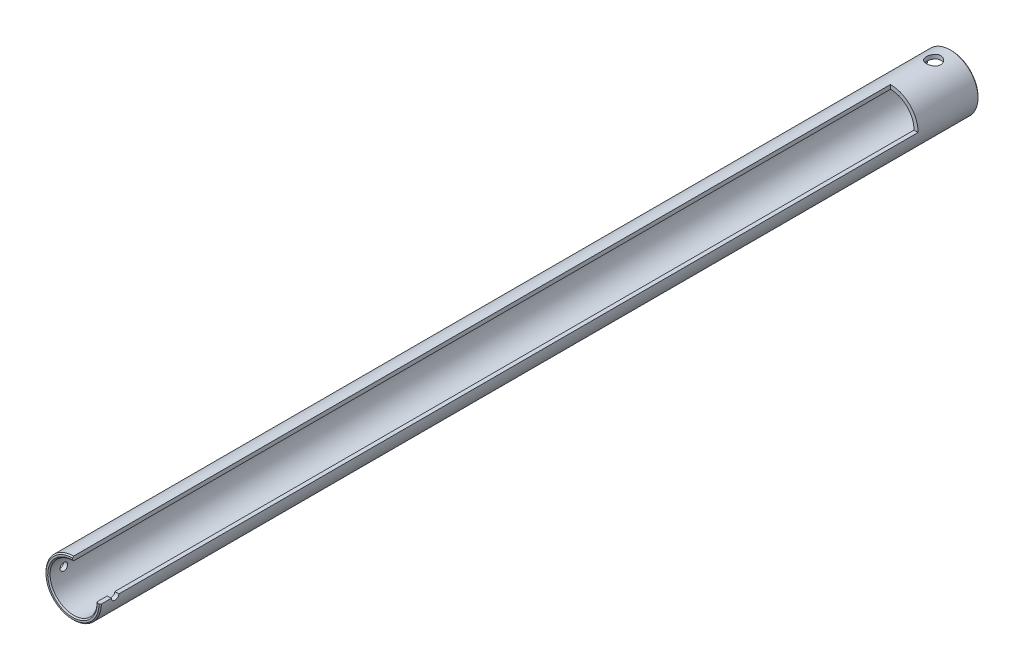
ISO-10303-21;
HEADER;
FILE_DESCRIPTION(('STEP AP214'),'2;1');
FILE_NAME('part.step','',(''),(''),'','','');
FILE_SCHEMA(('AUTOMOTIVE_DESIGN { 1 0 10303 214 1 1 1 1 }'));
ENDSEC;
DATA;
#1=APPLICATION_CONTEXT('core data for automotive mechanical design processes');
#2=APPLICATION_PROTOCOL_DEFINITION('international standard','automotive_design',2000,#1);
#3=PRODUCT_CONTEXT('',#1,'mechanical');
#4=PRODUCT('Part','Part','',(#3));
#5=PRODUCT_RELATED_PRODUCT_CATEGORY('part','',(#4));
#6=PRODUCT_DEFINITION_FORMATION('','',#4);
#7=PRODUCT_DEFINITION_CONTEXT('part definition',#1,'design');
#8=PRODUCT_DEFINITION('design','',#6,#7);
#9=PRODUCT_DEFINITION_SHAPE('','',#8);
#10=(LENGTH_UNIT() NAMED_UNIT(*) SI_UNIT(.MILLI.,.METRE.));
#11=(NAMED_UNIT(*) PLANE_ANGLE_UNIT() SI_UNIT($,.RADIAN.));
#12=(NAMED_UNIT(*) SI_UNIT($,.STERADIAN.) SOLID_ANGLE_UNIT());
#13=UNCERTAINTY_MEASURE_WITH_UNIT(LENGTH_MEASURE(1.E-05),#10,'distance_accuracy_value','');
#14=(GEOMETRIC_REPRESENTATION_CONTEXT(3) GLOBAL_UNCERTAINTY_ASSIGNED_CONTEXT((#13)) GLOBAL_UNIT_ASSIGNED_CONTEXT((#10,
#11,#12)) REPRESENTATION_CONTEXT('',''));
#15=CARTESIAN_POINT('',(0.,0.,0.));
#16=DIRECTION('',(0.,0.,1.));
#17=DIRECTION('',(1.,0.,0.));
#18=AXIS2_PLACEMENT_3D('',#15,#16,#17);
#19=CARTESIAN_POINT('',(0.,0.,558.8));
#20=DIRECTION('',(0.,0.,1.));
#21=DIRECTION('',(1.,0.,0.));
#22=AXIS2_PLACEMENT_3D('',#19,#20,#21);
#23=PLANE('',#22);
#24=DIRECTION('',(0.,-1.,0.));
#25=VECTOR('',#24,1.);
#26=CARTESIAN_POINT('',(0.,0.,558.8));
#27=LINE('',#26,#25);
#28=CARTESIAN_POINT('',(0.,16.85,558.8));
#29=VERTEX_POINT('',#28);
#30=CARTESIAN_POINT('',(0.,15.75,558.8));
#31=VERTEX_POINT('',#30);
#32=EDGE_CURVE('E53',#29,#31,#27,.T.);
#33=ORIENTED_EDGE('',*,*,#32,.F.);
#34=CARTESIAN_POINT('',(0.,0.,558.8));
#35=DIRECTION('',(0.,0.,1.));
#36=DIRECTION('',(1.,0.,0.));
#37=AXIS2_PLACEMENT_3D('',#34,#35,#36);
#38=CIRCLE('',#37,16.85);
#39=CARTESIAN_POINT('',(16.85,0.,558.8));
#40=VERTEX_POINT('',#39);
#41=EDGE_CURVE('E107',#29,#40,#38,.T.);
#42=ORIENTED_EDGE('',*,*,#41,.T.);
#43=DIRECTION('',(1.,0.,0.));
#44=VECTOR('',#43,1.);
#45=CARTESIAN_POINT('',(0.,0.,558.8));
#46=LINE('',#45,#44);
#47=CARTESIAN_POINT('',(15.75,0.,558.8));
#48=VERTEX_POINT('',#47);
#49=EDGE_CURVE('E110',#48,#40,#46,.T.);
#50=ORIENTED_EDGE('',*,*,#49,.F.);
#51=CARTESIAN_POINT('',(0.,0.,558.8));
#52=DIRECTION('',(0.,0.,1.));
#53=DIRECTION('',(1.,0.,0.));
#54=AXIS2_PLACEMENT_3D('',#51,#52,#53);
#55=CIRCLE('',#54,15.75);
#56=EDGE_CURVE('E109',#48,#31,#55,.F.);
#57=ORIENTED_EDGE('',*,*,#56,.T.);
#58=EDGE_LOOP('',(#33,#42,#50,#57));
#59=FACE_BOUND('',#58,.T.);
#60=ADVANCED_FACE('F29',(#59),#23,.T.);
#61=CARTESIAN_POINT('',(0.,0.,0.));
#62=DIRECTION('',(0.,0.,1.));
#63=DIRECTION('',(1.,0.,0.));
#64=AXIS2_PLACEMENT_3D('',#61,#62,#63);
#65=PLANE('',#64);
#66=CARTESIAN_POINT('',(0.,0.,0.));
#67=DIRECTION('',(0.,0.,1.));
#68=DIRECTION('',(1.,0.,0.));
#69=AXIS2_PLACEMENT_3D('',#66,#67,#68);
#70=CIRCLE('',#69,16.85);
#71=CARTESIAN_POINT('',(16.85,0.,0.));
#72=VERTEX_POINT('',#71);
#73=EDGE_CURVE('E134',#72,#72,#70,.F.);
#74=ORIENTED_EDGE('',*,*,#73,.T.);
#75=EDGE_LOOP('',(#74));
#76=FACE_BOUND('',#75,.T.);
#77=CARTESIAN_POINT('',(0.,0.,0.));
#78=DIRECTION('',(0.,0.,1.));
#79=DIRECTION('',(1.,0.,0.));
#80=AXIS2_PLACEMENT_3D('',#77,#78,#79);
#81=CIRCLE('',#80,15.75);
#82=CARTESIAN_POINT('',(15.75,0.,0.));
#83=VERTEX_POINT('',#82);
#84=EDGE_CURVE('E131',#83,#83,#81,.T.);
#85=ORIENTED_EDGE('',*,*,#84,.T.);
#86=EDGE_LOOP('',(#85));
#87=FACE_BOUND('',#86,.T.);
#88=ADVANCED_FACE('F256',(#76,#87),#65,.F.);
#89=CARTESIAN_POINT('',(0.,0.,558.8));
#90=DIRECTION('',(0.,0.,-1.));
#91=DIRECTION('',(-1.,0.,0.));
#92=AXIS2_PLACEMENT_3D('',#89,#90,#91);
#93=CYLINDRICAL_SURFACE('',#92,17.6);
#94=CARTESIAN_POINT('',(0.,-17.6,15.9));
#95=CARTESIAN_POINT('',(0.24844253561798,-17.5999959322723,15.8999933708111));
#96=CARTESIAN_POINT('',(0.496958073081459,-17.5946872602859,15.879356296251));
#97=CARTESIAN_POINT('',(0.98685443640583,-17.5740246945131,15.7974843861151));
#98=CARTESIAN_POINT('',(1.22823134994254,-17.5586653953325,15.7362277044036));
#99=CARTESIAN_POINT('',(1.69670621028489,-17.5196005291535,15.5752199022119));
#100=CARTESIAN_POINT('',(1.92382133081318,-17.4959052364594,15.4755161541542));
#101=CARTESIAN_POINT('',(2.35810364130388,-17.4426854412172,15.2406141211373));
#102=CARTESIAN_POINT('',(2.56526993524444,-17.4131606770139,15.1054142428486));
#103=CARTESIAN_POINT('',(2.95822084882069,-17.3507727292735,14.8002927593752));
#104=CARTESIAN_POINT('',(3.14351624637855,-17.317856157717,14.6297519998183));
#105=CARTESIAN_POINT('',(3.48321172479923,-17.2527451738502,14.2601146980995));
#106=CARTESIAN_POINT('',(3.63760815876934,-17.2205508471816,14.06101478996));
#107=CARTESIAN_POINT('',(3.91345197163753,-17.1599886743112,13.6360767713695));
#108=CARTESIAN_POINT('',(4.03434689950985,-17.1316884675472,13.4098695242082));
#109=CARTESIAN_POINT('',(4.23620134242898,-17.082899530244,12.9395010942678));
#110=CARTESIAN_POINT('',(4.31716756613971,-17.0624094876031,12.6953429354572));
#111=CARTESIAN_POINT('',(4.43518723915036,-17.0321103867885,12.2013960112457));
#112=CARTESIAN_POINT('',(4.47312280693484,-17.0220871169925,11.9518314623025));
#113=CARTESIAN_POINT('',(4.50675282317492,-17.0132156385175,11.4496946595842));
#114=CARTESIAN_POINT('',(4.50245448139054,-17.0143655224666,11.1971229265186));
#115=CARTESIAN_POINT('',(4.45244132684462,-17.02751814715,10.7029432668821));
#116=CARTESIAN_POINT('',(4.40778303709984,-17.0392440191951,10.4612198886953));
#117=CARTESIAN_POINT('',(4.2800053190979,-17.0717854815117,9.9888155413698));
#118=CARTESIAN_POINT('',(4.1968830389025,-17.0926017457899,9.75813539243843));
#119=CARTESIAN_POINT('',(3.99364977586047,-17.141229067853,9.31155912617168));
#120=CARTESIAN_POINT('',(3.87315973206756,-17.1691112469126,9.09584358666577));
#121=CARTESIAN_POINT('',(3.59887608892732,-17.2286892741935,8.68731670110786));
#122=CARTESIAN_POINT('',(3.44507641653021,-17.2603858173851,8.49450954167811));
#123=CARTESIAN_POINT('',(3.10309022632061,-17.3251825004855,8.13122395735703));
#124=CARTESIAN_POINT('',(2.91401357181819,-17.358296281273,7.96158481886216));
#125=CARTESIAN_POINT('',(2.50969611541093,-17.421343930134,7.65625859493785));
#126=CARTESIAN_POINT('',(2.29445444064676,-17.4512776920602,7.52057264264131));
#127=CARTESIAN_POINT('',(1.84268525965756,-17.5047529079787,7.28667589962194));
#128=CARTESIAN_POINT('',(1.60608143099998,-17.5282701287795,7.18860662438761));
#129=CARTESIAN_POINT('',(1.11900937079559,-17.5660866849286,7.03387158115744));
#130=CARTESIAN_POINT('',(0.868543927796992,-17.5803878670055,6.97719751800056));
#131=CARTESIAN_POINT('',(0.3680297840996,-17.5978856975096,6.90815544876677));
#132=CARTESIAN_POINT('',(0.118148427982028,-17.6013685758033,6.89464513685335));
#133=CARTESIAN_POINT('',(-0.380306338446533,-17.5976551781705,6.9091738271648));
#134=CARTESIAN_POINT('',(-0.628879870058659,-17.590459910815,6.93720890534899));
#135=CARTESIAN_POINT('',(-1.11365748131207,-17.5663826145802,7.03309245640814));
#136=CARTESIAN_POINT('',(-1.3499940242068,-17.5496534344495,7.10031308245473));
#137=CARTESIAN_POINT('',(-1.80802051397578,-17.5083976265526,7.27193845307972));
#138=CARTESIAN_POINT('',(-2.02970894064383,-17.4838701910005,7.37634704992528));
#139=CARTESIAN_POINT('',(-2.45665569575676,-17.4290579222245,7.62156652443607));
#140=CARTESIAN_POINT('',(-2.6615372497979,-17.3986755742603,7.76301106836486));
#141=CARTESIAN_POINT('',(-3.04506085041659,-17.3356696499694,8.07748189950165));
#142=CARTESIAN_POINT('',(-3.22369813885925,-17.3030456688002,8.25051390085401));
#143=CARTESIAN_POINT('',(-3.55440554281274,-17.2381953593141,8.62856129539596));
#144=CARTESIAN_POINT('',(-3.70567271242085,-17.2060009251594,8.8342857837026));
#145=CARTESIAN_POINT('',(-3.97154268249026,-17.1465879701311,9.26886806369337));
#146=CARTESIAN_POINT('',(-4.08614708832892,-17.1193692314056,9.49772484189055));
#147=CARTESIAN_POINT('',(-4.27457906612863,-17.0732945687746,9.97086994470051));
#148=CARTESIAN_POINT('',(-4.34864741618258,-17.0543893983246,10.2150573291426));
#149=CARTESIAN_POINT('',(-4.45451987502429,-17.0270460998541,10.7129796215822));
#150=CARTESIAN_POINT('',(-4.48633373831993,-17.0186055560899,10.9667123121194));
#151=CARTESIAN_POINT('',(-4.50626698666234,-17.0133372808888,11.4683356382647));
#152=CARTESIAN_POINT('',(-4.49567204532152,-17.0161678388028,11.7161723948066));
#153=CARTESIAN_POINT('',(-4.43404422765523,-17.0323294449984,12.2063993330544));
#154=CARTESIAN_POINT('',(-4.38301223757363,-17.0456602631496,12.4487896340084));
#155=CARTESIAN_POINT('',(-4.2426758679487,-17.0811254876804,12.9197716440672));
#156=CARTESIAN_POINT('',(-4.15362309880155,-17.1032019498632,13.1484429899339));
#157=CARTESIAN_POINT('',(-3.93997059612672,-17.1536767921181,13.5877659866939));
#158=CARTESIAN_POINT('',(-3.81536571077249,-17.1820760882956,13.7984150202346));
#159=CARTESIAN_POINT('',(-3.53016035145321,-17.2429621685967,14.2019013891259));
#160=CARTESIAN_POINT('',(-3.36867267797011,-17.2755391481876,14.3940980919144));
#161=CARTESIAN_POINT('',(-3.01600082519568,-17.3405834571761,14.7490828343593));
#162=CARTESIAN_POINT('',(-2.82480955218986,-17.3730507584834,14.9118638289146));
#163=CARTESIAN_POINT('',(-2.41373091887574,-17.4349613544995,15.2064499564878));
#164=CARTESIAN_POINT('',(-2.19336340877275,-17.4643346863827,15.3376009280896));
#165=CARTESIAN_POINT('',(-1.73297276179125,-17.5160009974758,15.5607868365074));
#166=CARTESIAN_POINT('',(-1.49296336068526,-17.5382988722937,15.652848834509));
#167=CARTESIAN_POINT('',(-1.04460987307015,-17.5701424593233,15.7821280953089));
#168=CARTESIAN_POINT('',(-0.838336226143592,-17.5812605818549,15.826232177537));
#169=CARTESIAN_POINT('',(-0.421392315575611,-17.5961907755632,15.8851697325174));
#170=CARTESIAN_POINT('',(-0.210722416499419,-17.6000034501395,15.9000056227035));
#171=CARTESIAN_POINT('',(0.,-17.6,15.9));
#172=B_SPLINE_CURVE_WITH_KNOTS('',3,(#94,#95,#96,#97,#98,#99,#100,#101,#102,#103,#104,#105,#106,
#107,#108,#109,#110,#111,#112,#113,#114,#115,#116,#117,#118,#119,#120,#121,#122,#123,#124,#125,
#126,#127,#128,#129,#130,#131,#132,#133,#134,#135,#136,#137,#138,#139,#140,#141,#142,#143,#144,
#145,#146,#147,#148,#149,#150,#151,#152,#153,#154,#155,#156,#157,#158,#159,#160,#161,#162,#163,
#164,#165,#166,#167,#168,#169,#170,#171),.UNSPECIFIED.,.T.,.F.,(4,2,2,2,2,2,2,2,2,2,2,2,2,2,2,2,
2,2,2,2,2,2,2,2,2,2,2,2,2,2,2,2,2,2,2,2,2,2,4),(0.,0.744555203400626,1.48951117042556,
2.23355216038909,2.9776265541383,3.73604609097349,4.49455508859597,5.26491433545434,
6.03514410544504,6.78928161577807,7.54329038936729,8.27811525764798,9.01299461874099,
9.75558695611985,10.4983147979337,11.2632345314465,12.0281797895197,12.7959752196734,
13.5636167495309,14.3107671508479,15.0578469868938,15.7932735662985,16.5287763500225,
17.2777946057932,18.0269484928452,18.7954013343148,19.5638205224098,20.3276244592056,
21.0912520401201,21.8319073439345,22.572546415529,23.3083583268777,24.0442769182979,
24.8002202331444,25.5563443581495,26.326974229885,27.0970697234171,27.7286340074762,
28.360146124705),.UNSPECIFIED.);
#173=CARTESIAN_POINT('',(0.,-17.6,15.9));
#174=VERTEX_POINT('',#173);
#175=EDGE_CURVE('E175',#174,#174,#172,.T.);
#176=ORIENTED_EDGE('',*,*,#175,.T.);
#177=EDGE_LOOP('',(#176));
#178=FACE_BOUND('',#177,.T.);
#179=CARTESIAN_POINT('',(0.,17.6,15.9));
#180=CARTESIAN_POINT('',(-0.248442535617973,17.5999959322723,15.8999933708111));
#181=CARTESIAN_POINT('',(-0.496958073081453,17.5946872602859,15.879356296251));
#182=CARTESIAN_POINT('',(-0.986854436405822,17.5740246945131,15.7974843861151));
#183=CARTESIAN_POINT('',(-1.22823134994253,17.5586653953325,15.7362277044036));
#184=CARTESIAN_POINT('',(-1.69670621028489,17.5196005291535,15.5752199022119));
#185=CARTESIAN_POINT('',(-1.92382133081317,17.4959052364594,15.4755161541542));
#186=CARTESIAN_POINT('',(-2.35810364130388,17.4426854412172,15.2406141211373));
#187=CARTESIAN_POINT('',(-2.56526993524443,17.4131606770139,15.1054142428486));
#188=CARTESIAN_POINT('',(-2.95822084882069,17.3507727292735,14.8002927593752));
#189=CARTESIAN_POINT('',(-3.14351624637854,17.317856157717,14.6297519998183));
#190=CARTESIAN_POINT('',(-3.48321172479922,17.2527451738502,14.2601146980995));
#191=CARTESIAN_POINT('',(-3.63760815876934,17.2205508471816,14.06101478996));
#192=CARTESIAN_POINT('',(-3.91345197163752,17.1599886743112,13.6360767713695));
#193=CARTESIAN_POINT('',(-4.03434689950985,17.1316884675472,13.4098695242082));
#194=CARTESIAN_POINT('',(-4.23620134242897,17.082899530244,12.9395010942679));
#195=CARTESIAN_POINT('',(-4.3171675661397,17.0624094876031,12.6953429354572));
#196=CARTESIAN_POINT('',(-4.43518723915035,17.0321103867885,12.2013960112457));
#197=CARTESIAN_POINT('',(-4.47312280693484,17.0220871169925,11.9518314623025));
#198=CARTESIAN_POINT('',(-4.50675282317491,17.0132156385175,11.4496946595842));
#199=CARTESIAN_POINT('',(-4.50245448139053,17.0143655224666,11.1971229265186));
#200=CARTESIAN_POINT('',(-4.45244132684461,17.02751814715,10.7029432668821));
#201=CARTESIAN_POINT('',(-4.40778303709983,17.0392440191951,10.4612198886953));
#202=CARTESIAN_POINT('',(-4.28000531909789,17.0717854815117,9.9888155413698));
#203=CARTESIAN_POINT('',(-4.19688303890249,17.0926017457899,9.75813539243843));
#204=CARTESIAN_POINT('',(-3.99364977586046,17.141229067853,9.31155912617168));
#205=CARTESIAN_POINT('',(-3.87315973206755,17.1691112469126,9.09584358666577));
#206=CARTESIAN_POINT('',(-3.59887608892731,17.2286892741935,8.68731670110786));
#207=CARTESIAN_POINT('',(-3.44507641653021,17.2603858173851,8.49450954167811));
#208=CARTESIAN_POINT('',(-3.1030902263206,17.3251825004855,8.13122395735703));
#209=CARTESIAN_POINT('',(-2.91401357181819,17.358296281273,7.96158481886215));
#210=CARTESIAN_POINT('',(-2.50969611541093,17.421343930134,7.65625859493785));
#211=CARTESIAN_POINT('',(-2.29445444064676,17.4512776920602,7.52057264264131));
#212=CARTESIAN_POINT('',(-1.84268525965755,17.5047529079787,7.28667589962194));
#213=CARTESIAN_POINT('',(-1.60608143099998,17.5282701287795,7.18860662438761));
#214=CARTESIAN_POINT('',(-1.11900937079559,17.5660866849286,7.03387158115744));
#215=CARTESIAN_POINT('',(-0.868543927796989,17.5803878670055,6.97719751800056));
#216=CARTESIAN_POINT('',(-0.368029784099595,17.5978856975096,6.90815544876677));
#217=CARTESIAN_POINT('',(-0.118148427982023,17.6013685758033,6.89464513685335));
#218=CARTESIAN_POINT('',(0.380306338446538,17.5976551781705,6.9091738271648));
#219=CARTESIAN_POINT('',(0.628879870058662,17.590459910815,6.93720890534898));
#220=CARTESIAN_POINT('',(1.11365748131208,17.5663826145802,7.03309245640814));
#221=CARTESIAN_POINT('',(1.34999402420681,17.5496534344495,7.10031308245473));
#222=CARTESIAN_POINT('',(1.80802051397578,17.5083976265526,7.27193845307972));
#223=CARTESIAN_POINT('',(2.02970894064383,17.4838701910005,7.37634704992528));
#224=CARTESIAN_POINT('',(2.45665569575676,17.4290579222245,7.62156652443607));
#225=CARTESIAN_POINT('',(2.6615372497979,17.3986755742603,7.76301106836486));
#226=CARTESIAN_POINT('',(3.04506085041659,17.3356696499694,8.07748189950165));
#227=CARTESIAN_POINT('',(3.22369813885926,17.3030456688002,8.25051390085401));
#228=CARTESIAN_POINT('',(3.55440554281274,17.2381953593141,8.62856129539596));
#229=CARTESIAN_POINT('',(3.70567271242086,17.2060009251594,8.8342857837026));
#230=CARTESIAN_POINT('',(3.97154268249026,17.1465879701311,9.26886806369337));
#231=CARTESIAN_POINT('',(4.08614708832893,17.1193692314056,9.49772484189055));
#232=CARTESIAN_POINT('',(4.27457906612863,17.0732945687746,9.97086994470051));
#233=CARTESIAN_POINT('',(4.34864741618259,17.0543893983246,10.2150573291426));
#234=CARTESIAN_POINT('',(4.4545198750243,17.0270460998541,10.7129796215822));
#235=CARTESIAN_POINT('',(4.48633373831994,17.0186055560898,10.9667123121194));
#236=CARTESIAN_POINT('',(4.50626698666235,17.0133372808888,11.4683356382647));
#237=CARTESIAN_POINT('',(4.49567204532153,17.0161678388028,11.7161723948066));
#238=CARTESIAN_POINT('',(4.43404422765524,17.0323294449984,12.2063993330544));
#239=CARTESIAN_POINT('',(4.38301223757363,17.0456602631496,12.4487896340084));
#240=CARTESIAN_POINT('',(4.24267586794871,17.0811254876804,12.9197716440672));
#241=CARTESIAN_POINT('',(4.15362309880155,17.1032019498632,13.1484429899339));
#242=CARTESIAN_POINT('',(3.93997059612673,17.1536767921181,13.5877659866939));
#243=CARTESIAN_POINT('',(3.8153657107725,17.1820760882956,13.7984150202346));
#244=CARTESIAN_POINT('',(3.53016035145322,17.2429621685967,14.2019013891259));
#245=CARTESIAN_POINT('',(3.36867267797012,17.2755391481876,14.3940980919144));
#246=CARTESIAN_POINT('',(3.0160008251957,17.3405834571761,14.7490828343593));
#247=CARTESIAN_POINT('',(2.82480955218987,17.3730507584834,14.9118638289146));
#248=CARTESIAN_POINT('',(2.41373091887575,17.4349613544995,15.2064499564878));
#249=CARTESIAN_POINT('',(2.19336340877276,17.4643346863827,15.3376009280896));
#250=CARTESIAN_POINT('',(1.73297276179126,17.5160009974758,15.5607868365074));
#251=CARTESIAN_POINT('',(1.49296336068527,17.5382988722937,15.652848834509));
#252=CARTESIAN_POINT('',(1.04460987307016,17.5701424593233,15.7821280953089));
#253=CARTESIAN_POINT('',(0.838336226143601,17.5812605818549,15.826232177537));
#254=CARTESIAN_POINT('',(0.421392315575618,17.5961907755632,15.8851697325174));
#255=CARTESIAN_POINT('',(0.210722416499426,17.6000034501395,15.9000056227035));
#256=CARTESIAN_POINT('',(0.,17.6,15.9));
#257=B_SPLINE_CURVE_WITH_KNOTS('',3,(#179,#180,#181,#182,#183,#184,#185,#186,#187,#188,#189,
#190,#191,#192,#193,#194,#195,#196,#197,#198,#199,#200,#201,#202,#203,#204,#205,#206,#207,#208,
#209,#210,#211,#212,#213,#214,#215,#216,#217,#218,#219,#220,#221,#222,#223,#224,#225,#226,#227,
#228,#229,#230,#231,#232,#233,#234,#235,#236,#237,#238,#239,#240,#241,#242,#243,#244,#245,#246,
#247,#248,#249,#250,#251,#252,#253,#254,#255,#256),.UNSPECIFIED.,.T.,.F.,(4,2,2,2,2,2,2,2,2,2,2,
2,2,2,2,2,2,2,2,2,2,2,2,2,2,2,2,2,2,2,2,2,2,2,2,2,2,2,4),(0.,0.744555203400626,1.48951117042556,
2.23355216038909,2.9776265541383,3.73604609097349,4.49455508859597,5.26491433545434,
6.03514410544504,6.78928161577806,7.54329038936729,8.27811525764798,9.01299461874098,
9.75558695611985,10.4983147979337,11.2632345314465,12.0281797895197,12.7959752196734,
13.5636167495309,14.3107671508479,15.0578469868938,15.7932735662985,16.5287763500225,
17.2777946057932,18.0269484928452,18.7954013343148,19.5638205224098,20.3276244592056,
21.0912520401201,21.8319073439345,22.572546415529,23.3083583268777,24.0442769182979,
24.8002202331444,25.5563443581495,26.326974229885,27.0970697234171,27.7286340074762,
28.360146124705),.UNSPECIFIED.);
#258=CARTESIAN_POINT('',(0.,17.6,15.9));
#259=VERTEX_POINT('',#258);
#260=EDGE_CURVE('E170',#259,#259,#257,.T.);
#261=ORIENTED_EDGE('',*,*,#260,.T.);
#262=EDGE_LOOP('',(#261));
#263=FACE_BOUND('',#262,.T.);
#264=CARTESIAN_POINT('',(17.6,0.,546.9));
#265=CARTESIAN_POINT('',(17.5999979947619,-0.134141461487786,546.900005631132));
#266=CARTESIAN_POINT('',(17.598450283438,-0.268364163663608,546.911284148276));
#267=CARTESIAN_POINT('',(17.5924250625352,-0.533067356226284,546.956094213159));
#268=CARTESIAN_POINT('',(17.5879445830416,-0.663543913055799,546.98964831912));
#269=CARTESIAN_POINT('',(17.5765580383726,-0.916884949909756,547.077996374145));
#270=CARTESIAN_POINT('',(17.5696536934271,-1.03975475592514,547.132775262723));
#271=CARTESIAN_POINT('',(17.5541851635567,-1.27453648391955,547.261983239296));
#272=CARTESIAN_POINT('',(17.5456212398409,-1.38645012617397,547.336409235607));
#273=CARTESIAN_POINT('',(17.527725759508,-1.59689210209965,547.503315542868));
#274=CARTESIAN_POINT('',(17.5183900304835,-1.69533885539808,547.595898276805));
#275=CARTESIAN_POINT('',(17.5000363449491,-1.87534934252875,547.796269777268));
#276=CARTESIAN_POINT('',(17.491018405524,-1.95691216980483,547.904059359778));
#277=CARTESIAN_POINT('',(17.4742806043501,-2.1011496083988,548.132323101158));
#278=CARTESIAN_POINT('',(17.4665661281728,-2.16374666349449,548.252846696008));
#279=CARTESIAN_POINT('',(17.4533647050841,-2.26778023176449,548.502818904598));
#280=CARTESIAN_POINT('',(17.4478776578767,-2.30921769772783,548.632267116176));
#281=CARTESIAN_POINT('',(17.4397927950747,-2.36950544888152,548.895561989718));
#282=CARTESIAN_POINT('',(17.4371772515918,-2.38849438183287,549.029376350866));
#283=CARTESIAN_POINT('',(17.4350775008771,-2.40377528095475,549.298315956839));
#284=CARTESIAN_POINT('',(17.4355931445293,-2.4000683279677,549.433441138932));
#285=CARTESIAN_POINT('',(17.4396812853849,-2.37017627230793,549.700194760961));
#286=CARTESIAN_POINT('',(17.4432329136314,-2.34414462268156,549.831840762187));
#287=CARTESIAN_POINT('',(17.4529602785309,-2.27058188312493,550.088878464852));
#288=CARTESIAN_POINT('',(17.459136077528,-2.22305028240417,550.214270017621));
#289=CARTESIAN_POINT('',(17.4734393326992,-2.10767426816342,550.45571188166));
#290=CARTESIAN_POINT('',(17.481573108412,-2.03976390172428,550.571730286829));
#291=CARTESIAN_POINT('',(17.498871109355,-1.88560516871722,550.790782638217));
#292=CARTESIAN_POINT('',(17.5080353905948,-1.79935580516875,550.893815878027));
#293=CARTESIAN_POINT('',(17.5264543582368,-1.61012044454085,551.084863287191));
#294=CARTESIAN_POINT('',(17.5357091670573,-1.5070023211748,551.1727466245));
#295=CARTESIAN_POINT('',(17.5531959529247,-1.28740951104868,551.329978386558));
#296=CARTESIAN_POINT('',(17.5614279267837,-1.17093478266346,551.399326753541));
#297=CARTESIAN_POINT('',(17.5759480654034,-0.92782875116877,551.517522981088));
#298=CARTESIAN_POINT('',(17.5822353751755,-0.801193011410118,551.566361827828));
#299=CARTESIAN_POINT('',(17.5921503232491,-0.541412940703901,551.642044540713));
#300=CARTESIAN_POINT('',(17.5957781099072,-0.408268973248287,551.66888963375));
#301=CARTESIAN_POINT('',(17.59994582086,-0.140382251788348,551.699651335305));
#302=CARTESIAN_POINT('',(17.6005099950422,-0.00566053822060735,551.703748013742));
#303=CARTESIAN_POINT('',(17.5985526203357,0.262547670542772,551.689372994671));
#304=CARTESIAN_POINT('',(17.5960311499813,0.396034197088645,551.670901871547));
#305=CARTESIAN_POINT('',(17.5882008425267,0.657445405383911,551.612065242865));
#306=CARTESIAN_POINT('',(17.5829030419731,0.785389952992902,551.571786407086));
#307=CARTESIAN_POINT('',(17.5701127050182,1.03270902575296,551.470568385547));
#308=CARTESIAN_POINT('',(17.562620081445,1.15208321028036,551.409628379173));
#309=CARTESIAN_POINT('',(17.5462138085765,1.37967182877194,551.268387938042));
#310=CARTESIAN_POINT('',(17.5372917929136,1.48781396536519,551.18797199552));
#311=CARTESIAN_POINT('',(17.5190488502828,1.68913122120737,551.010224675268));
#312=CARTESIAN_POINT('',(17.5097279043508,1.78230562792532,550.912892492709));
#313=CARTESIAN_POINT('',(17.4916619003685,1.9516885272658,550.703278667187));
#314=CARTESIAN_POINT('',(17.4829212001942,2.02777706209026,550.59089965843));
#315=CARTESIAN_POINT('',(17.4670794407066,2.15999743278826,550.35485070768));
#316=CARTESIAN_POINT('',(17.4599783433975,2.2161297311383,550.231181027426));
#317=CARTESIAN_POINT('',(17.4482503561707,2.3066535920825,549.976435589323));
#318=CARTESIAN_POINT('',(17.4436159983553,2.34111083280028,549.845383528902));
#319=CARTESIAN_POINT('',(17.4373254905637,2.38751696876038,549.579285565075));
#320=CARTESIAN_POINT('',(17.4356691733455,2.39946712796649,549.444239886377));
#321=CARTESIAN_POINT('',(17.4355277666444,2.40049370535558,549.175182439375));
#322=CARTESIAN_POINT('',(17.4370165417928,2.38975863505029,549.041171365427));
#323=CARTESIAN_POINT('',(17.4429411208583,2.34612074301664,548.776878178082));
#324=CARTESIAN_POINT('',(17.4473769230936,2.31321793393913,548.646596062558));
#325=CARTESIAN_POINT('',(17.4586872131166,2.22624090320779,548.393495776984));
#326=CARTESIAN_POINT('',(17.4655604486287,2.17217755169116,548.270673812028));
#327=CARTESIAN_POINT('',(17.480972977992,2.04443263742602,548.03581392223));
#328=CARTESIAN_POINT('',(17.4895123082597,1.9707506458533,547.923776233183));
#329=CARTESIAN_POINT('',(17.5073796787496,1.80516664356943,547.71270394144));
#330=CARTESIAN_POINT('',(17.5167134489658,1.71312445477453,547.613779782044));
#331=CARTESIAN_POINT('',(17.5350685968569,1.51372778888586,547.432711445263));
#332=CARTESIAN_POINT('',(17.5440899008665,1.40636973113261,547.350571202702));
#333=CARTESIAN_POINT('',(17.5608494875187,1.17882478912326,547.205078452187));
#334=CARTESIAN_POINT('',(17.56858178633,1.05858210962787,547.141812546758));
#335=CARTESIAN_POINT('',(17.5818325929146,0.8091355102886,547.036464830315));
#336=CARTESIAN_POINT('',(17.5873534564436,0.679941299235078,546.99436046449));
#337=CARTESIAN_POINT('',(17.594258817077,0.458429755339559,546.942383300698));
#338=CARTESIAN_POINT('',(17.5964010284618,0.367497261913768,546.926513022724));
#339=CARTESIAN_POINT('',(17.5992723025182,0.184389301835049,546.90531948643));
#340=CARTESIAN_POINT('',(17.6000013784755,0.0922138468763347,546.89999612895));
#341=CARTESIAN_POINT('',(17.6,0.,546.9));
#342=B_SPLINE_CURVE_WITH_KNOTS('',3,(#264,#265,#266,#267,#268,#269,#270,#271,#272,#273,#274,
#275,#276,#277,#278,#279,#280,#281,#282,#283,#284,#285,#286,#287,#288,#289,#290,#291,#292,#293,
#294,#295,#296,#297,#298,#299,#300,#301,#302,#303,#304,#305,#306,#307,#308,#309,#310,#311,#312,
#313,#314,#315,#316,#317,#318,#319,#320,#321,#322,#323,#324,#325,#326,#327,#328,#329,#330,#331,
#332,#333,#334,#335,#336,#337,#338,#339,#340,#341),.UNSPECIFIED.,.T.,.F.,(4,2,2,2,2,2,2,2,2,2,2,
2,2,2,2,2,2,2,2,2,2,2,2,2,2,2,2,2,2,2,2,2,2,2,2,2,2,2,4),(0.,0.402087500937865,
0.804582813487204,1.20679304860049,1.60894002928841,2.01342441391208,2.41793051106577,
2.8240690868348,3.23018937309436,3.63378803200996,4.03736747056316,4.43819486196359,
4.83903177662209,5.24118019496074,5.64335048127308,6.04883655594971,6.45432389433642,
6.8599892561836,7.26563198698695,7.66805913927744,8.07047604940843,8.471305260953,
8.87215039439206,9.27543372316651,9.67873624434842,10.0847874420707,10.490829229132,
10.8956346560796,11.3004173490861,11.7018495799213,12.1032815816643,12.5045076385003,
12.9057424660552,13.3101667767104,13.714685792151,14.1210333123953,14.5269468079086,
14.8033593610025,15.0797693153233),.UNSPECIFIED.);
#343=CARTESIAN_POINT('',(17.6,0.,546.9));
#344=VERTEX_POINT('',#343);
#345=CARTESIAN_POINT('',(17.6,0.,551.7));
#346=VERTEX_POINT('',#345);
#347=EDGE_CURVE('E182',#344,#346,#342,.T.);
#348=ORIENTED_EDGE('',*,*,#347,.T.);
#349=DIRECTION('',(0.,0.,-1.));
#350=VECTOR('',#349,1.);
#351=CARTESIAN_POINT('',(17.6,0.,558.8));
#352=LINE('',#351,#350);
#353=CARTESIAN_POINT('',(17.6,0.,558.05));
#354=VERTEX_POINT('',#353);
#355=EDGE_CURVE('E224',#346,#354,#352,.F.);
#356=ORIENTED_EDGE('',*,*,#355,.T.);
#357=CARTESIAN_POINT('',(0.,0.,558.05));
#358=DIRECTION('',(0.,0.,1.));
#359=DIRECTION('',(1.,0.,0.));
#360=AXIS2_PLACEMENT_3D('',#357,#358,#359);
#361=CIRCLE('',#360,17.6);
#362=CARTESIAN_POINT('',(0.,17.6,558.05));
#363=VERTEX_POINT('',#362);
#364=EDGE_CURVE('E118',#354,#363,#361,.F.);
#365=ORIENTED_EDGE('',*,*,#364,.T.);
#366=DIRECTION('',(0.,0.,-1.));
#367=VECTOR('',#366,1.);
#368=CARTESIAN_POINT('',(0.,17.6,558.8));
#369=LINE('',#368,#367);
#370=CARTESIAN_POINT('',(0.,17.6,38.7999999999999));
#371=VERTEX_POINT('',#370);
#372=EDGE_CURVE('E96',#363,#371,#369,.T.);
#373=ORIENTED_EDGE('',*,*,#372,.T.);
#374=CARTESIAN_POINT('',(0.,0.,38.7999999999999));
#375=DIRECTION('',(0.,0.,-1.));
#376=DIRECTION('',(-1.,0.,0.));
#377=AXIS2_PLACEMENT_3D('',#374,#375,#376);
#378=CIRCLE('',#377,17.6);
#379=CARTESIAN_POINT('',(17.6,0.,38.7999999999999));
#380=VERTEX_POINT('',#379);
#381=EDGE_CURVE('E146',#371,#380,#378,.T.);
#382=ORIENTED_EDGE('',*,*,#381,.T.);
#383=EDGE_CURVE('E229',#380,#344,#352,.F.);
#384=ORIENTED_EDGE('',*,*,#383,.T.);
#385=EDGE_LOOP('',(#348,#356,#365,#373,#382,#384));
#386=FACE_BOUND('',#385,.T.);
#387=CARTESIAN_POINT('',(0.,0.,0.750000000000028));
#388=DIRECTION('',(0.,0.,1.));
#389=DIRECTION('',(1.,0.,0.));
#390=AXIS2_PLACEMENT_3D('',#387,#388,#389);
#391=CIRCLE('',#390,17.6);
#392=CARTESIAN_POINT('',(17.6,0.,0.750000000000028));
#393=VERTEX_POINT('',#392);
#394=EDGE_CURVE('E115',#393,#393,#391,.T.);
#395=ORIENTED_EDGE('',*,*,#394,.T.);
#396=EDGE_LOOP('',(#395));
#397=FACE_BOUND('',#396,.T.);
#398=CARTESIAN_POINT('',(-17.6,0.,551.7));
#399=CARTESIAN_POINT('',(-17.5999979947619,-0.134141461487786,551.699994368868));
#400=CARTESIAN_POINT('',(-17.598450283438,-0.26836416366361,551.688715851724));
#401=CARTESIAN_POINT('',(-17.5924250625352,-0.533067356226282,551.643905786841));
#402=CARTESIAN_POINT('',(-17.5879445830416,-0.663543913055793,551.61035168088));
#403=CARTESIAN_POINT('',(-17.5765580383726,-0.916884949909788,551.522003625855));
#404=CARTESIAN_POINT('',(-17.5696536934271,-1.03975475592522,551.467224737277));
#405=CARTESIAN_POINT('',(-17.5541851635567,-1.27453648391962,551.338016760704));
#406=CARTESIAN_POINT('',(-17.5456212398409,-1.38645012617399,551.263590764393));
#407=CARTESIAN_POINT('',(-17.527725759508,-1.59689210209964,551.096684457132));
#408=CARTESIAN_POINT('',(-17.5183900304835,-1.69533885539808,551.004101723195));
#409=CARTESIAN_POINT('',(-17.5000363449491,-1.87534934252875,550.803730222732));
#410=CARTESIAN_POINT('',(-17.491018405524,-1.95691216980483,550.695940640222));
#411=CARTESIAN_POINT('',(-17.4742806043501,-2.1011496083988,550.467676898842));
#412=CARTESIAN_POINT('',(-17.4665661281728,-2.16374666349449,550.347153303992));
#413=CARTESIAN_POINT('',(-17.4533647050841,-2.26778023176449,550.097181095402));
#414=CARTESIAN_POINT('',(-17.4478776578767,-2.30921769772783,549.967732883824));
#415=CARTESIAN_POINT('',(-17.4397927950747,-2.36950544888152,549.704438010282));
#416=CARTESIAN_POINT('',(-17.4371772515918,-2.38849438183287,549.570623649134));
#417=CARTESIAN_POINT('',(-17.4350775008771,-2.40377528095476,549.301684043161));
#418=CARTESIAN_POINT('',(-17.4355931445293,-2.4000683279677,549.166558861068));
#419=CARTESIAN_POINT('',(-17.4396812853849,-2.37017627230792,548.899805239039));
#420=CARTESIAN_POINT('',(-17.4432329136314,-2.34414462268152,548.768159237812));
#421=CARTESIAN_POINT('',(-17.4529602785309,-2.27058188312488,548.511121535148));
#422=CARTESIAN_POINT('',(-17.459136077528,-2.22305028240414,548.385729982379));
#423=CARTESIAN_POINT('',(-17.4734393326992,-2.10767426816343,548.14428811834));
#424=CARTESIAN_POINT('',(-17.481573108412,-2.03976390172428,548.028269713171));
#425=CARTESIAN_POINT('',(-17.498871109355,-1.88560516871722,547.809217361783));
#426=CARTESIAN_POINT('',(-17.5080353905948,-1.79935580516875,547.706184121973));
#427=CARTESIAN_POINT('',(-17.5264543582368,-1.61012044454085,547.515136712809));
#428=CARTESIAN_POINT('',(-17.5357091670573,-1.5070023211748,547.4272533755));
#429=CARTESIAN_POINT('',(-17.5531959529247,-1.28740951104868,547.270021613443));
#430=CARTESIAN_POINT('',(-17.5614279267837,-1.17093478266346,547.200673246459));
#431=CARTESIAN_POINT('',(-17.5759480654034,-0.927828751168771,547.082477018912));
#432=CARTESIAN_POINT('',(-17.5822353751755,-0.801193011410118,547.033638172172));
#433=CARTESIAN_POINT('',(-17.5921503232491,-0.541412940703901,546.957955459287));
#434=CARTESIAN_POINT('',(-17.5957781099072,-0.408268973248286,546.93111036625));
#435=CARTESIAN_POINT('',(-17.59994582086,-0.140382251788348,546.900348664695));
#436=CARTESIAN_POINT('',(-17.6005099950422,-0.00566053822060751,546.896251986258));
#437=CARTESIAN_POINT('',(-17.5985526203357,0.262547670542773,546.910627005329));
#438=CARTESIAN_POINT('',(-17.5960311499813,0.396034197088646,546.929098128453));
#439=CARTESIAN_POINT('',(-17.5882008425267,0.65744540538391,546.987934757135));
#440=CARTESIAN_POINT('',(-17.5829030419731,0.7853899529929,547.028213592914));
#441=CARTESIAN_POINT('',(-17.5701127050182,1.03270902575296,547.129431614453));
#442=CARTESIAN_POINT('',(-17.562620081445,1.15208321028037,547.190371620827));
#443=CARTESIAN_POINT('',(-17.5462138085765,1.37967182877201,547.331612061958));
#444=CARTESIAN_POINT('',(-17.5372917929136,1.4878139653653,547.412028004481));
#445=CARTESIAN_POINT('',(-17.5190488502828,1.68913122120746,547.589775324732));
#446=CARTESIAN_POINT('',(-17.5097279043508,1.78230562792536,547.687107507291));
#447=CARTESIAN_POINT('',(-17.4916619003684,1.95168852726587,547.896721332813));
#448=CARTESIAN_POINT('',(-17.4829212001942,2.02777706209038,548.00910034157));
#449=CARTESIAN_POINT('',(-17.4670794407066,2.15999743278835,548.24514929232));
#450=CARTESIAN_POINT('',(-17.4599783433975,2.21612973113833,548.368818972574));
#451=CARTESIAN_POINT('',(-17.4482503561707,2.3066535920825,548.623564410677));
#452=CARTESIAN_POINT('',(-17.4436159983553,2.34111083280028,548.754616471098));
#453=CARTESIAN_POINT('',(-17.4373254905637,2.38751696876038,549.020714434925));
#454=CARTESIAN_POINT('',(-17.4356691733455,2.39946712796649,549.155760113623));
#455=CARTESIAN_POINT('',(-17.4355277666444,2.40049370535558,549.424817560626));
#456=CARTESIAN_POINT('',(-17.4370165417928,2.38975863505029,549.558828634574));
#457=CARTESIAN_POINT('',(-17.4429411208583,2.34612074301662,549.823121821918));
#458=CARTESIAN_POINT('',(-17.4473769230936,2.31321793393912,549.953403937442));
#459=CARTESIAN_POINT('',(-17.4586872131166,2.22624090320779,550.206504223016));
#460=CARTESIAN_POINT('',(-17.4655604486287,2.17217755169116,550.329326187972));
#461=CARTESIAN_POINT('',(-17.480972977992,2.04443263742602,550.56418607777));
#462=CARTESIAN_POINT('',(-17.4895123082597,1.9707506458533,550.676223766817));
#463=CARTESIAN_POINT('',(-17.5073796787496,1.80516664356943,550.88729605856));
#464=CARTESIAN_POINT('',(-17.5167134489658,1.71312445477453,550.986220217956));
#465=CARTESIAN_POINT('',(-17.5350685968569,1.51372778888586,551.167288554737));
#466=CARTESIAN_POINT('',(-17.5440899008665,1.40636973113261,551.249428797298));
#467=CARTESIAN_POINT('',(-17.5608494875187,1.17882478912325,551.394921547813));
#468=CARTESIAN_POINT('',(-17.56858178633,1.05858210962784,551.458187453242));
#469=CARTESIAN_POINT('',(-17.5818325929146,0.809135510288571,551.563535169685));
#470=CARTESIAN_POINT('',(-17.5873534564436,0.679941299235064,551.60563953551));
#471=CARTESIAN_POINT('',(-17.594258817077,0.45842975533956,551.657616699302));
#472=CARTESIAN_POINT('',(-17.5964010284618,0.367497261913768,551.673486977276));
#473=CARTESIAN_POINT('',(-17.5992723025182,0.184389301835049,551.69468051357));
#474=CARTESIAN_POINT('',(-17.6000013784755,0.0922138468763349,551.70000387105));
#475=CARTESIAN_POINT('',(-17.6,0.,551.7));
#476=B_SPLINE_CURVE_WITH_KNOTS('',3,(#398,#399,#400,#401,#402,#403,#404,#405,#406,#407,#408,
#409,#410,#411,#412,#413,#414,#415,#416,#417,#418,#419,#420,#421,#422,#423,#424,#425,#426,#427,
#428,#429,#430,#431,#432,#433,#434,#435,#436,#437,#438,#439,#440,#441,#442,#443,#444,#445,#446,
#447,#448,#449,#450,#451,#452,#453,#454,#455,#456,#457,#458,#459,#460,#461,#462,#463,#464,#465,
#466,#467,#468,#469,#470,#471,#472,#473,#474,#475),.UNSPECIFIED.,.T.,.F.,(4,2,2,2,2,2,2,2,2,2,2,
2,2,2,2,2,2,2,2,2,2,2,2,2,2,2,2,2,2,2,2,2,2,2,2,2,2,2,4),(0.,0.402087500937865,
0.804582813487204,1.20679304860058,1.60894002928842,2.01342441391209,2.41793051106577,
2.82406908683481,3.23018937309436,3.63378803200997,4.03736747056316,4.43819486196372,
4.8390317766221,5.24118019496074,5.64335048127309,6.04883655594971,6.45432389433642,
6.8599892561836,7.26563198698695,7.66805913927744,8.07047604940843,8.471305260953,
8.87215039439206,9.27543372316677,9.67873624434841,10.084787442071,10.490829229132,
10.8956346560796,11.3004173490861,11.7018495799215,12.1032815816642,12.5045076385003,
12.9057424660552,13.3101667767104,13.714685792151,14.1210333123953,14.5269468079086,
14.8033593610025,15.0797693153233),.UNSPECIFIED.);
#477=CARTESIAN_POINT('',(-17.6,0.,551.7));
#478=VERTEX_POINT('',#477);
#479=EDGE_CURVE('E120',#478,#478,#476,.T.);
#480=ORIENTED_EDGE('',*,*,#479,.T.);
#481=EDGE_LOOP('',(#480));
#482=FACE_BOUND('',#481,.T.);
#483=ADVANCED_FACE('F31',(#178,#263,#386,#397,#482),#93,.T.);
#484=CARTESIAN_POINT('',(0.,0.,558.8));
#485=DIRECTION('',(0.,0.,-1.));
#486=DIRECTION('',(-1.,0.,0.));
#487=AXIS2_PLACEMENT_3D('',#484,#485,#486);
#488=CYLINDRICAL_SURFACE('',#487,15.);
#489=DIRECTION('',(0.,0.,-1.));
#490=VECTOR('',#489,1.);
#491=CARTESIAN_POINT('',(15.,0.,558.8));
#492=LINE('',#491,#490);
#493=CARTESIAN_POINT('',(15.,0.,551.7));
#494=VERTEX_POINT('',#493);
#495=CARTESIAN_POINT('',(15.,0.,558.05));
#496=VERTEX_POINT('',#495);
#497=EDGE_CURVE('E45',#494,#496,#492,.F.);
#498=ORIENTED_EDGE('',*,*,#497,.F.);
#499=CARTESIAN_POINT('',(15.,0.,546.9));
#500=CARTESIAN_POINT('',(14.9999977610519,-0.133892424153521,546.900005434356));
#501=CARTESIAN_POINT('',(14.9981885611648,-0.267859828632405,546.911242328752));
#502=CARTESIAN_POINT('',(14.9911454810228,-0.532042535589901,546.955877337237));
#503=CARTESIAN_POINT('',(14.9859083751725,-0.662254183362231,546.98929632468));
#504=CARTESIAN_POINT('',(14.9725973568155,-0.915064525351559,547.077265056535));
#505=CARTESIAN_POINT('',(14.964525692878,-1.0376691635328,547.131798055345));
#506=CARTESIAN_POINT('',(14.9464348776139,-1.27197101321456,547.260404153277));
#507=CARTESIAN_POINT('',(14.9364159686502,-1.38366957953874,547.33447482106));
#508=CARTESIAN_POINT('',(14.9154437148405,-1.59399299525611,547.500750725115));
#509=CARTESIAN_POINT('',(14.9044836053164,-1.69250743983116,547.593094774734));
#510=CARTESIAN_POINT('',(14.8829164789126,-1.87271292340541,547.79299736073));
#511=CARTESIAN_POINT('',(14.872309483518,-1.95440294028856,547.900556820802));
#512=CARTESIAN_POINT('',(14.8525840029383,-2.09907798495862,548.128588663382));
#513=CARTESIAN_POINT('',(14.843474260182,-2.16195479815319,548.249130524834));
#514=CARTESIAN_POINT('',(14.8278679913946,-2.26652677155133,548.499234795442));
#515=CARTESIAN_POINT('',(14.8213713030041,-2.30822324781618,548.628796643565));
#516=CARTESIAN_POINT('',(14.8117937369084,-2.36890510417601,548.892096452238));
#517=CARTESIAN_POINT('',(14.8086843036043,-2.38808045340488,549.02578957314));
#518=CARTESIAN_POINT('',(14.8061468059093,-2.40376453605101,549.294529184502));
#519=CARTESIAN_POINT('',(14.8067185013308,-2.40027474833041,549.429575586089));
#520=CARTESIAN_POINT('',(14.8114525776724,-2.37088256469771,549.695838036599));
#521=CARTESIAN_POINT('',(14.8155808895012,-2.34519281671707,549.827078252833));
#522=CARTESIAN_POINT('',(14.8269097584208,-2.27246332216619,550.083361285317));
#523=CARTESIAN_POINT('',(14.834110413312,-2.22542289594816,550.208403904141));
#524=CARTESIAN_POINT('',(14.8508097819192,-2.11110946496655,550.449383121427));
#525=CARTESIAN_POINT('',(14.8603185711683,-2.04374742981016,550.565276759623));
#526=CARTESIAN_POINT('',(14.8805556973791,-1.89076623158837,550.784196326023));
#527=CARTESIAN_POINT('',(14.8912841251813,-1.80514570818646,550.887221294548));
#528=CARTESIAN_POINT('',(14.9129017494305,-1.61691580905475,551.078710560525));
#529=CARTESIAN_POINT('',(14.9237913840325,-1.51412382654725,551.166995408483));
#530=CARTESIAN_POINT('',(14.944391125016,-1.29508844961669,551.325089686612));
#531=CARTESIAN_POINT('',(14.954101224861,-1.17884498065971,551.394899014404));
#532=CARTESIAN_POINT('',(14.9712600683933,-0.936043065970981,551.514074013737));
#533=CARTESIAN_POINT('',(14.9787071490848,-0.809477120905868,551.563424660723));
#534=CARTESIAN_POINT('',(14.9904873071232,-0.54970780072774,551.640119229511));
#535=CARTESIAN_POINT('',(14.9948206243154,-0.416504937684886,551.667464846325));
#536=CARTESIAN_POINT('',(14.9998529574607,-0.148790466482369,551.699131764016));
#537=CARTESIAN_POINT('',(15.0005908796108,-0.0143087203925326,551.703699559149));
#538=CARTESIAN_POINT('',(14.998455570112,0.253499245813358,551.690337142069));
#539=CARTESIAN_POINT('',(14.9955824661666,0.386825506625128,551.672407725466));
#540=CARTESIAN_POINT('',(14.9865720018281,0.647782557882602,551.614764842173));
#541=CARTESIAN_POINT('',(14.9804528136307,0.775440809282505,551.575172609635));
#542=CARTESIAN_POINT('',(14.9656337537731,1.02230758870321,551.475456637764));
#543=CARTESIAN_POINT('',(14.9569337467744,1.14151567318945,551.415331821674));
#544=CARTESIAN_POINT('',(14.9378222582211,1.36917438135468,551.275687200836));
#545=CARTESIAN_POINT('',(14.9273973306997,1.47752880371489,551.196012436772));
#546=CARTESIAN_POINT('',(14.9060351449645,1.6794169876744,551.019743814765));
#547=CARTESIAN_POINT('',(14.89509785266,1.77294976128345,550.923148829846));
#548=CARTESIAN_POINT('',(14.8738188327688,1.9434463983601,550.714679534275));
#549=CARTESIAN_POINT('',(14.8634837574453,2.02024424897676,550.602668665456));
#550=CARTESIAN_POINT('',(14.8447009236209,2.15393387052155,550.367191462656));
#551=CARTESIAN_POINT('',(14.8362531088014,2.21082623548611,550.243725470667));
#552=CARTESIAN_POINT('',(14.8222504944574,2.3028379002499,549.989319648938));
#553=CARTESIAN_POINT('',(14.8166844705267,2.33804177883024,549.858411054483));
#554=CARTESIAN_POINT('',(14.8090467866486,2.38594462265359,549.59244291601));
#555=CARTESIAN_POINT('',(14.8069748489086,2.39864537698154,549.457383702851));
#556=CARTESIAN_POINT('',(14.8065712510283,2.40113455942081,549.188604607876));
#557=CARTESIAN_POINT('',(14.8081969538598,2.39118417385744,549.054887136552));
#558=CARTESIAN_POINT('',(14.8149123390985,2.3492162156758,548.791054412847));
#559=CARTESIAN_POINT('',(14.8200020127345,2.31719869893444,548.660939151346));
#560=CARTESIAN_POINT('',(14.8330561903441,2.23210226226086,548.40809357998));
#561=CARTESIAN_POINT('',(14.8410178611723,2.17904409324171,548.28535613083));
#562=CARTESIAN_POINT('',(14.858921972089,2.053398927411,548.050482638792));
#563=CARTESIAN_POINT('',(14.868864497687,1.98081108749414,547.938347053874));
#564=CARTESIAN_POINT('',(14.8897460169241,1.81722796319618,547.726537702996));
#565=CARTESIAN_POINT('',(14.9006947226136,1.72603997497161,547.627013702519));
#566=CARTESIAN_POINT('',(14.922276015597,1.52825201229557,547.444589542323));
#567=CARTESIAN_POINT('',(14.932908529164,1.42164847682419,547.361693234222));
#568=CARTESIAN_POINT('',(14.9527368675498,1.19525801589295,547.214403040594));
#569=CARTESIAN_POINT('',(14.9619231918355,1.07539205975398,547.150129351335));
#570=CARTESIAN_POINT('',(14.9777314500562,0.826470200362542,547.042726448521));
#571=CARTESIAN_POINT('',(14.984355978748,0.697423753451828,546.999575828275));
#572=CARTESIAN_POINT('',(14.9928210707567,0.473202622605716,546.945185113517));
#573=CARTESIAN_POINT('',(14.9954990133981,0.379396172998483,546.928267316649));
#574=CARTESIAN_POINT('',(14.9990892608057,0.190405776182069,546.905672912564));
#575=CARTESIAN_POINT('',(15.000001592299,0.0952218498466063,546.899996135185));
#576=CARTESIAN_POINT('',(15.,0.,546.9));
#577=B_SPLINE_CURVE_WITH_KNOTS('',3,(#499,#500,#501,#502,#503,#504,#505,#506,#507,#508,#509,
#510,#511,#512,#513,#514,#515,#516,#517,#518,#519,#520,#521,#522,#523,#524,#525,#526,#527,#528,
#529,#530,#531,#532,#533,#534,#535,#536,#537,#538,#539,#540,#541,#542,#543,#544,#545,#546,#547,
#548,#549,#550,#551,#552,#553,#554,#555,#556,#557,#558,#559,#560,#561,#562,#563,#564,#565,#566,
#567,#568,#569,#570,#571,#572,#573,#574,#575,#576),.UNSPECIFIED.,.T.,.F.,(4,2,2,2,2,2,2,2,2,2,2,
2,2,2,2,2,2,2,2,2,2,2,2,2,2,2,2,2,2,2,2,2,2,2,2,2,2,2,4),(0.,0.401329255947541,
0.803036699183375,1.20442619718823,1.60576576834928,2.01028001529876,2.41481883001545,
2.82164171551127,3.22843931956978,3.63178030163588,4.03509496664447,4.43458867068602,
4.83409509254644,5.23537784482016,5.63669050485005,6.04257976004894,6.44847126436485,
6.8546603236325,7.26081809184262,7.66257086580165,8.06430943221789,8.46382236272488,
8.86335624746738,9.26616551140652,9.66900161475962,10.0756683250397,10.4823228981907,
10.887381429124,11.2924077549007,11.692787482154,12.0931661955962,12.4931510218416,
12.8931531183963,13.297531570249,13.7020035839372,14.1090308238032,14.5156447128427,
14.8010670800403,15.0864851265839),.UNSPECIFIED.);
#578=CARTESIAN_POINT('',(15.,0.,546.9));
#579=VERTEX_POINT('',#578);
#580=EDGE_CURVE('E181',#579,#494,#577,.T.);
#581=ORIENTED_EDGE('',*,*,#580,.F.);
#582=CARTESIAN_POINT('',(15.,0.,38.7999999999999));
#583=VERTEX_POINT('',#582);
#584=EDGE_CURVE('E219',#583,#579,#492,.F.);
#585=ORIENTED_EDGE('',*,*,#584,.F.);
#586=CARTESIAN_POINT('',(0.,0.,38.7999999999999));
#587=DIRECTION('',(0.,0.,-1.));
#588=DIRECTION('',(-1.,0.,0.));
#589=AXIS2_PLACEMENT_3D('',#586,#587,#588);
#590=CIRCLE('',#589,15.);
#591=CARTESIAN_POINT('',(0.,15.,38.7999999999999));
#592=VERTEX_POINT('',#591);
#593=EDGE_CURVE('E11',#592,#583,#590,.T.);
#594=ORIENTED_EDGE('',*,*,#593,.F.);
#595=DIRECTION('',(0.,0.,-1.));
#596=VECTOR('',#595,1.);
#597=CARTESIAN_POINT('',(0.,15.,558.8));
#598=LINE('',#597,#596);
#599=CARTESIAN_POINT('',(0.,15.,558.05));
#600=VERTEX_POINT('',#599);
#601=EDGE_CURVE('E101',#600,#592,#598,.T.);
#602=ORIENTED_EDGE('',*,*,#601,.F.);
#603=CARTESIAN_POINT('',(0.,0.,558.05));
#604=DIRECTION('',(0.,0.,1.));
#605=DIRECTION('',(1.,0.,0.));
#606=AXIS2_PLACEMENT_3D('',#603,#604,#605);
#607=CIRCLE('',#606,15.);
#608=EDGE_CURVE('E128',#600,#496,#607,.T.);
#609=ORIENTED_EDGE('',*,*,#608,.T.);
#610=EDGE_LOOP('',(#498,#581,#585,#594,#602,#609));
#611=FACE_BOUND('',#610,.T.);
#612=CARTESIAN_POINT('',(0.,-15.,15.9));
#613=CARTESIAN_POINT('',(0.246865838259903,-14.9999978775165,15.8999970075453));
#614=CARTESIAN_POINT('',(0.493761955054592,-14.9938474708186,15.8796184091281));
#615=CARTESIAN_POINT('',(0.980364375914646,-14.9699131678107,15.7988359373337));
#616=CARTESIAN_POINT('',(1.22006851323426,-14.9521258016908,15.73842012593));
#617=CARTESIAN_POINT('',(1.68519812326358,-14.9068665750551,15.5797619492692));
#618=CARTESIAN_POINT('',(1.91064409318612,-14.8794090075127,15.4815753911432));
#619=CARTESIAN_POINT('',(2.3418725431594,-14.8176632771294,15.2503917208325));
#620=CARTESIAN_POINT('',(2.54765240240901,-14.7833742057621,15.1173899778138));
#621=CARTESIAN_POINT('',(2.93961539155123,-14.7105221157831,14.816327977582));
#622=CARTESIAN_POINT('',(3.12515421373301,-14.6718715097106,14.6474501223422));
#623=CARTESIAN_POINT('',(3.46574762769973,-14.5951750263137,14.2811723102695));
#624=CARTESIAN_POINT('',(3.62079708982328,-14.5571292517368,14.0837675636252));
#625=CARTESIAN_POINT('',(3.89940113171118,-14.4850234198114,13.6605877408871));
#626=CARTESIAN_POINT('',(4.02216927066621,-14.4510721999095,13.4342746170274));
#627=CARTESIAN_POINT('',(4.22764184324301,-14.3923086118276,12.9630322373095));
#628=CARTESIAN_POINT('',(4.31035589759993,-14.3674940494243,12.7181074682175));
#629=CARTESIAN_POINT('',(4.43104901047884,-14.3307261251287,12.2238292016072));
#630=CARTESIAN_POINT('',(4.47021588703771,-14.3184320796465,11.974791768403));
#631=CARTESIAN_POINT('',(4.50641191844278,-14.3070836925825,11.4734005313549));
#632=CARTESIAN_POINT('',(4.5034512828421,-14.3080261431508,11.2210475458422));
#633=CARTESIAN_POINT('',(4.45640931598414,-14.3227423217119,10.7298482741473));
#634=CARTESIAN_POINT('',(4.41381615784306,-14.3360516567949,10.4908432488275));
#635=CARTESIAN_POINT('',(4.29112261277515,-14.373250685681,10.0235406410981));
#636=CARTESIAN_POINT('',(4.2110185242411,-14.3971414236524,9.79524411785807));
#637=CARTESIAN_POINT('',(4.01448079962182,-14.4531819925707,9.35219895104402));
#638=CARTESIAN_POINT('',(3.89756450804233,-14.4854404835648,9.13767874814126));
#639=CARTESIAN_POINT('',(3.63105667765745,-14.5545296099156,8.73080393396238));
#640=CARTESIAN_POINT('',(3.48145722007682,-14.5913613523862,8.53845471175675));
#641=CARTESIAN_POINT('',(3.14643872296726,-14.6673303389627,8.17294142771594));
#642=CARTESIAN_POINT('',(2.95978472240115,-14.7064996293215,8.00091400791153));
#643=CARTESIAN_POINT('',(2.55978977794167,-14.7813673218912,7.69033804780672));
#644=CARTESIAN_POINT('',(2.3464471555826,-14.8170655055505,7.55179161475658));
#645=CARTESIAN_POINT('',(1.89706511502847,-14.8812948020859,7.31142023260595));
#646=CARTESIAN_POINT('',(1.66088324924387,-14.9097763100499,7.20984745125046));
#647=CARTESIAN_POINT('',(1.17373624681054,-14.9560056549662,7.04820122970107));
#648=CARTESIAN_POINT('',(0.922775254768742,-14.9737564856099,6.98811621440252));
#649=CARTESIAN_POINT('',(0.422856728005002,-14.9960509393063,6.91304346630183));
#650=CARTESIAN_POINT('',(0.174150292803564,-15.0010455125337,6.89651524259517));
#651=CARTESIAN_POINT('',(-0.322498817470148,-14.9985876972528,6.90470746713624));
#652=CARTESIAN_POINT('',(-0.57044159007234,-14.9911369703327,6.92942240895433));
#653=CARTESIAN_POINT('',(-1.05271081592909,-14.9649209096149,7.01815383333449));
#654=CARTESIAN_POINT('',(-1.2872183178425,-14.9464148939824,7.08127016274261));
#655=CARTESIAN_POINT('',(-1.74226391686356,-14.900230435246,7.2439296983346));
#656=CARTESIAN_POINT('',(-1.96280033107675,-14.8725508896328,7.34347728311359));
#657=CARTESIAN_POINT('',(-2.38931156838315,-14.8100896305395,7.5787594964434));
#658=CARTESIAN_POINT('',(-2.594831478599,-14.7751584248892,7.71527802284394));
#659=CARTESIAN_POINT('',(-2.98056992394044,-14.7022040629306,8.01967426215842));
#660=CARTESIAN_POINT('',(-3.16078209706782,-14.6641801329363,8.18755983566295));
#661=CARTESIAN_POINT('',(-3.49757233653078,-14.5875951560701,8.55716192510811));
#662=CARTESIAN_POINT('',(-3.65305443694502,-14.5490647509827,8.75988562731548));
#663=CARTESIAN_POINT('',(-3.92786985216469,-14.4772954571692,9.18938381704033));
#664=CARTESIAN_POINT('',(-4.04720411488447,-14.4440564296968,9.41615767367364));
#665=CARTESIAN_POINT('',(-4.24552041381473,-14.3870156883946,9.88659747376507));
#666=CARTESIAN_POINT('',(-4.32469040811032,-14.3631701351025,10.1301785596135));
#667=CARTESIAN_POINT('',(-4.44065192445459,-14.3277478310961,10.6280639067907));
#668=CARTESIAN_POINT('',(-4.47745796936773,-14.3161668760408,10.8823644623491));
#669=CARTESIAN_POINT('',(-4.50665953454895,-14.3069991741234,11.3830845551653));
#670=CARTESIAN_POINT('',(-4.5008416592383,-14.3088494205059,11.6293909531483));
#671=CARTESIAN_POINT('',(-4.44922516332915,-14.3249820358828,12.1173423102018));
#672=CARTESIAN_POINT('',(-4.40342814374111,-14.3392639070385,12.3589874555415));
#673=CARTESIAN_POINT('',(-4.27430666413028,-14.3782729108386,12.827836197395));
#674=CARTESIAN_POINT('',(-4.19145526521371,-14.402868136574,13.0551818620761));
#675=CARTESIAN_POINT('',(-3.99094521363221,-14.459708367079,13.4929273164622));
#676=CARTESIAN_POINT('',(-3.87327989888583,-14.4919548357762,13.7033238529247));
#677=CARTESIAN_POINT('',(-3.60146291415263,-14.5619302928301,14.1094893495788));
#678=CARTESIAN_POINT('',(-3.44613828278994,-14.5998162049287,14.3044462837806));
#679=CARTESIAN_POINT('',(-3.10552303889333,-14.676039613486,14.6661074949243));
#680=CARTESIAN_POINT('',(-2.92022465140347,-14.7143772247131,14.8328044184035));
#681=CARTESIAN_POINT('',(-2.51839728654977,-14.7885280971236,15.1380702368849));
#682=CARTESIAN_POINT('',(-2.30111365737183,-14.8242347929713,15.2756743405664));
#683=CARTESIAN_POINT('',(-1.84542412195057,-14.8878204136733,15.5122055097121));
#684=CARTESIAN_POINT('',(-1.60702815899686,-14.9157029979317,15.6111506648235));
#685=CARTESIAN_POINT('',(-1.14227313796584,-14.9580652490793,15.7586858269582));
#686=CARTESIAN_POINT('',(-0.917360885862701,-14.9736608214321,15.8115350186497));
#687=CARTESIAN_POINT('',(-0.461640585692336,-14.9946283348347,15.8821905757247));
#688=CARTESIAN_POINT('',(-0.230833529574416,-15.0000019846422,15.9000027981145));
#689=CARTESIAN_POINT('',(0.,-15.,15.9));
#690=B_SPLINE_CURVE_WITH_KNOTS('',3,(#612,#613,#614,#615,#616,#617,#618,#619,#620,#621,#622,
#623,#624,#625,#626,#627,#628,#629,#630,#631,#632,#633,#634,#635,#636,#637,#638,#639,#640,#641,
#642,#643,#644,#645,#646,#647,#648,#649,#650,#651,#652,#653,#654,#655,#656,#657,#658,#659,#660,
#661,#662,#663,#664,#665,#666,#667,#668,#669,#670,#671,#672,#673,#674,#675,#676,#677,#678,#679,
#680,#681,#682,#683,#684,#685,#686,#687,#688,#689),.UNSPECIFIED.,.T.,.F.,(4,2,2,2,2,2,2,2,2,2,2,
2,2,2,2,2,2,2,2,2,2,2,2,2,2,2,2,2,2,2,2,2,2,2,2,2,2,2,4),(0.,0.739749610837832,1.479719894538,
2.21860102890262,2.9575804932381,3.71566808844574,4.47388311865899,5.24914443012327,
6.02421943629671,6.77759068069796,7.53077934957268,8.25678050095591,8.98285330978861,
9.71887279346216,10.4550708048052,11.2220131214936,11.9890036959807,12.7611314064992,
13.5330436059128,14.2772642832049,15.0213856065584,15.7487024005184,16.4761066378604,
17.2203391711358,17.9647584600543,18.7362120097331,19.507645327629,20.2754344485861,
21.0429602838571,21.7785046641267,22.5140195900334,23.240401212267,23.9669219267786,
24.7199077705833,25.4730892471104,26.2482898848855,27.0231273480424,27.7149507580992,
28.4066585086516),.UNSPECIFIED.);
#691=CARTESIAN_POINT('',(0.,-15.,15.9));
#692=VERTEX_POINT('',#691);
#693=EDGE_CURVE('E145',#692,#692,#690,.T.);
#694=ORIENTED_EDGE('',*,*,#693,.F.);
#695=EDGE_LOOP('',(#694));
#696=FACE_BOUND('',#695,.T.);
#697=CARTESIAN_POINT('',(0.,15.,15.9));
#698=CARTESIAN_POINT('',(-0.246865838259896,14.9999978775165,15.8999970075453));
#699=CARTESIAN_POINT('',(-0.493761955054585,14.9938474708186,15.8796184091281));
#700=CARTESIAN_POINT('',(-0.980364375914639,14.9699131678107,15.7988359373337));
#701=CARTESIAN_POINT('',(-1.22006851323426,14.9521258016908,15.73842012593));
#702=CARTESIAN_POINT('',(-1.68519812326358,14.9068665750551,15.5797619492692));
#703=CARTESIAN_POINT('',(-1.91064409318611,14.8794090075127,15.4815753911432));
#704=CARTESIAN_POINT('',(-2.34187254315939,14.8176632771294,15.2503917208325));
#705=CARTESIAN_POINT('',(-2.54765240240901,14.7833742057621,15.1173899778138));
#706=CARTESIAN_POINT('',(-2.93961539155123,14.7105221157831,14.816327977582));
#707=CARTESIAN_POINT('',(-3.125154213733,14.6718715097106,14.6474501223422));
#708=CARTESIAN_POINT('',(-3.46574762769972,14.5951750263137,14.2811723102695));
#709=CARTESIAN_POINT('',(-3.62079708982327,14.5571292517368,14.0837675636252));
#710=CARTESIAN_POINT('',(-3.89940113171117,14.4850234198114,13.6605877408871));
#711=CARTESIAN_POINT('',(-4.0221692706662,14.4510721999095,13.4342746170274));
#712=CARTESIAN_POINT('',(-4.227641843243,14.3923086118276,12.9630322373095));
#713=CARTESIAN_POINT('',(-4.31035589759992,14.3674940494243,12.7181074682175));
#714=CARTESIAN_POINT('',(-4.43104901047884,14.3307261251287,12.2238292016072));
#715=CARTESIAN_POINT('',(-4.4702158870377,14.3184320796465,11.9747917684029));
#716=CARTESIAN_POINT('',(-4.50641191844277,14.3070836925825,11.4734005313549));
#717=CARTESIAN_POINT('',(-4.5034512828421,14.3080261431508,11.2210475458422));
#718=CARTESIAN_POINT('',(-4.45640931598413,14.3227423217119,10.7298482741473));
#719=CARTESIAN_POINT('',(-4.41381615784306,14.3360516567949,10.4908432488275));
#720=CARTESIAN_POINT('',(-4.29112261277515,14.373250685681,10.0235406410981));
#721=CARTESIAN_POINT('',(-4.21101852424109,14.3971414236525,9.79524411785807));
#722=CARTESIAN_POINT('',(-4.01448079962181,14.4531819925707,9.35219895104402));
#723=CARTESIAN_POINT('',(-3.89756450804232,14.4854404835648,9.13767874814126));
#724=CARTESIAN_POINT('',(-3.63105667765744,14.5545296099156,8.73080393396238));
#725=CARTESIAN_POINT('',(-3.48145722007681,14.5913613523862,8.53845471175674));
#726=CARTESIAN_POINT('',(-3.14643872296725,14.6673303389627,8.17294142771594));
#727=CARTESIAN_POINT('',(-2.95978472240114,14.7064996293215,8.00091400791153));
#728=CARTESIAN_POINT('',(-2.55978977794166,14.7813673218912,7.69033804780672));
#729=CARTESIAN_POINT('',(-2.3464471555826,14.8170655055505,7.55179161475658));
#730=CARTESIAN_POINT('',(-1.89706511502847,14.8812948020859,7.31142023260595));
#731=CARTESIAN_POINT('',(-1.66088324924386,14.9097763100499,7.20984745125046));
#732=CARTESIAN_POINT('',(-1.17373624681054,14.9560056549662,7.04820122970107));
#733=CARTESIAN_POINT('',(-0.922775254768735,14.9737564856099,6.98811621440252));
#734=CARTESIAN_POINT('',(-0.422856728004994,14.9960509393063,6.91304346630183));
#735=CARTESIAN_POINT('',(-0.174150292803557,15.0010455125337,6.89651524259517));
#736=CARTESIAN_POINT('',(0.322498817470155,14.9985876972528,6.90470746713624));
#737=CARTESIAN_POINT('',(0.570441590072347,14.9911369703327,6.92942240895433));
#738=CARTESIAN_POINT('',(1.05271081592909,14.9649209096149,7.01815383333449));
#739=CARTESIAN_POINT('',(1.28721831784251,14.9464148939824,7.08127016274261));
#740=CARTESIAN_POINT('',(1.74226391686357,14.900230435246,7.2439296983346));
#741=CARTESIAN_POINT('',(1.96280033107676,14.8725508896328,7.34347728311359));
#742=CARTESIAN_POINT('',(2.38931156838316,14.8100896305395,7.5787594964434));
#743=CARTESIAN_POINT('',(2.59483147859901,14.7751584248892,7.71527802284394));
#744=CARTESIAN_POINT('',(2.98056992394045,14.7022040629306,8.01967426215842));
#745=CARTESIAN_POINT('',(3.16078209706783,14.6641801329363,8.18755983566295));
#746=CARTESIAN_POINT('',(3.49757233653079,14.5875951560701,8.55716192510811));
#747=CARTESIAN_POINT('',(3.65305443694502,14.5490647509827,8.75988562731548));
#748=CARTESIAN_POINT('',(3.92786985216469,14.4772954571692,9.18938381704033));
#749=CARTESIAN_POINT('',(4.04720411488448,14.4440564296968,9.41615767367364));
#750=CARTESIAN_POINT('',(4.24552041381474,14.3870156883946,9.88659747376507));
#751=CARTESIAN_POINT('',(4.32469040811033,14.3631701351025,10.1301785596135));
#752=CARTESIAN_POINT('',(4.4406519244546,14.3277478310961,10.6280639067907));
#753=CARTESIAN_POINT('',(4.47745796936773,14.3161668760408,10.8823644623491));
#754=CARTESIAN_POINT('',(4.50665953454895,14.3069991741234,11.3830845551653));
#755=CARTESIAN_POINT('',(4.50084165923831,14.3088494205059,11.6293909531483));
#756=CARTESIAN_POINT('',(4.44922516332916,14.3249820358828,12.1173423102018));
#757=CARTESIAN_POINT('',(4.40342814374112,14.3392639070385,12.3589874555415));
#758=CARTESIAN_POINT('',(4.27430666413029,14.3782729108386,12.827836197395));
#759=CARTESIAN_POINT('',(4.19145526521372,14.402868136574,13.0551818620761));
#760=CARTESIAN_POINT('',(3.99094521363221,14.459708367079,13.4929273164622));
#761=CARTESIAN_POINT('',(3.87327989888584,14.4919548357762,13.7033238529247));
#762=CARTESIAN_POINT('',(3.60146291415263,14.5619302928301,14.1094893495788));
#763=CARTESIAN_POINT('',(3.44613828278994,14.5998162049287,14.3044462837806));
#764=CARTESIAN_POINT('',(3.10552303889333,14.676039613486,14.6661074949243));
#765=CARTESIAN_POINT('',(2.92022465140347,14.7143772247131,14.8328044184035));
#766=CARTESIAN_POINT('',(2.51839728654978,14.7885280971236,15.1380702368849));
#767=CARTESIAN_POINT('',(2.30111365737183,14.8242347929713,15.2756743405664));
#768=CARTESIAN_POINT('',(1.84542412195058,14.8878204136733,15.5122055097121));
#769=CARTESIAN_POINT('',(1.60702815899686,14.9157029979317,15.6111506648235));
#770=CARTESIAN_POINT('',(1.14227313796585,14.9580652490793,15.7586858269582));
#771=CARTESIAN_POINT('',(0.917360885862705,14.9736608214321,15.8115350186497));
#772=CARTESIAN_POINT('',(0.46164058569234,14.9946283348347,15.8821905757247));
#773=CARTESIAN_POINT('',(0.230833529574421,15.0000019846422,15.9000027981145));
#774=CARTESIAN_POINT('',(0.,15.,15.9));
#775=B_SPLINE_CURVE_WITH_KNOTS('',3,(#697,#698,#699,#700,#701,#702,#703,#704,#705,#706,#707,
#708,#709,#710,#711,#712,#713,#714,#715,#716,#717,#718,#719,#720,#721,#722,#723,#724,#725,#726,
#727,#728,#729,#730,#731,#732,#733,#734,#735,#736,#737,#738,#739,#740,#741,#742,#743,#744,#745,
#746,#747,#748,#749,#750,#751,#752,#753,#754,#755,#756,#757,#758,#759,#760,#761,#762,#763,#764,
#765,#766,#767,#768,#769,#770,#771,#772,#773,#774),.UNSPECIFIED.,.T.,.F.,(4,2,2,2,2,2,2,2,2,2,2,
2,2,2,2,2,2,2,2,2,2,2,2,2,2,2,2,2,2,2,2,2,2,2,2,2,2,2,4),(0.,0.739749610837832,1.479719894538,
2.21860102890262,2.9575804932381,3.71566808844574,4.47388311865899,5.24914443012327,
6.02421943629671,6.77759068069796,7.53077934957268,8.25678050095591,8.98285330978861,
9.71887279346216,10.4550708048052,11.2220131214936,11.9890036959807,12.7611314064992,
13.5330436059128,14.2772642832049,15.0213856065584,15.7487024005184,16.4761066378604,
17.2203391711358,17.9647584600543,18.7362120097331,19.507645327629,20.2754344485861,
21.0429602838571,21.7785046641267,22.5140195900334,23.240401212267,23.9669219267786,
24.7199077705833,25.4730892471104,26.2482898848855,27.0231273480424,27.7149507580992,
28.4066585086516),.UNSPECIFIED.);
#776=CARTESIAN_POINT('',(0.,15.,15.9));
#777=VERTEX_POINT('',#776);
#778=EDGE_CURVE('E138',#777,#777,#775,.T.);
#779=ORIENTED_EDGE('',*,*,#778,.F.);
#780=EDGE_LOOP('',(#779));
#781=FACE_BOUND('',#780,.T.);
#782=CARTESIAN_POINT('',(0.,0.,0.750000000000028));
#783=DIRECTION('',(0.,0.,1.));
#784=DIRECTION('',(1.,0.,0.));
#785=AXIS2_PLACEMENT_3D('',#782,#783,#784);
#786=CIRCLE('',#785,15.);
#787=CARTESIAN_POINT('',(15.,0.,0.750000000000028));
#788=VERTEX_POINT('',#787);
#789=EDGE_CURVE('E125',#788,#788,#786,.F.);
#790=ORIENTED_EDGE('',*,*,#789,.T.);
#791=EDGE_LOOP('',(#790));
#792=FACE_BOUND('',#791,.T.);
#793=CARTESIAN_POINT('',(-15.,0.,551.7));
#794=CARTESIAN_POINT('',(-14.9999977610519,-0.13389242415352,551.699994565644));
#795=CARTESIAN_POINT('',(-14.9981885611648,-0.267859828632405,551.688757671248));
#796=CARTESIAN_POINT('',(-14.9911454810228,-0.532042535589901,551.644122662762));
#797=CARTESIAN_POINT('',(-14.9859083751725,-0.662254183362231,551.61070367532));
#798=CARTESIAN_POINT('',(-14.9725973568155,-0.915064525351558,551.522734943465));
#799=CARTESIAN_POINT('',(-14.964525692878,-1.0376691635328,551.468201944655));
#800=CARTESIAN_POINT('',(-14.9464348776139,-1.27197101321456,551.339595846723));
#801=CARTESIAN_POINT('',(-14.9364159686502,-1.38366957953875,551.26552517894));
#802=CARTESIAN_POINT('',(-14.9154437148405,-1.59399299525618,551.099249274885));
#803=CARTESIAN_POINT('',(-14.9044836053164,-1.69250743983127,551.006905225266));
#804=CARTESIAN_POINT('',(-14.8829164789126,-1.87271292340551,550.80700263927));
#805=CARTESIAN_POINT('',(-14.872309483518,-1.95440294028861,550.699443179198));
#806=CARTESIAN_POINT('',(-14.8525840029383,-2.09907798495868,550.471411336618));
#807=CARTESIAN_POINT('',(-14.843474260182,-2.16195479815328,550.350869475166));
#808=CARTESIAN_POINT('',(-14.8278679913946,-2.26652677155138,550.100765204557));
#809=CARTESIAN_POINT('',(-14.8213713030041,-2.3082232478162,549.971203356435));
#810=CARTESIAN_POINT('',(-14.8117937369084,-2.36890510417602,549.707903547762));
#811=CARTESIAN_POINT('',(-14.8086843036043,-2.38808045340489,549.57421042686));
#812=CARTESIAN_POINT('',(-14.8061468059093,-2.40376453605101,549.305470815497));
#813=CARTESIAN_POINT('',(-14.8067185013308,-2.4002747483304,549.170424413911));
#814=CARTESIAN_POINT('',(-14.8114525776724,-2.37088256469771,548.904161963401));
#815=CARTESIAN_POINT('',(-14.8155808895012,-2.34519281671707,548.772921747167));
#816=CARTESIAN_POINT('',(-14.8269097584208,-2.27246332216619,548.516638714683));
#817=CARTESIAN_POINT('',(-14.834110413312,-2.22542289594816,548.391596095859));
#818=CARTESIAN_POINT('',(-14.8508097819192,-2.11110946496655,548.150616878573));
#819=CARTESIAN_POINT('',(-14.8603185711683,-2.04374742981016,548.034723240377));
#820=CARTESIAN_POINT('',(-14.8805556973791,-1.89076623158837,547.815803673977));
#821=CARTESIAN_POINT('',(-14.8912841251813,-1.80514570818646,547.712778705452));
#822=CARTESIAN_POINT('',(-14.9129017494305,-1.61691580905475,547.521289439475));
#823=CARTESIAN_POINT('',(-14.9237913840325,-1.51412382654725,547.433004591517));
#824=CARTESIAN_POINT('',(-14.944391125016,-1.29508844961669,547.274910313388));
#825=CARTESIAN_POINT('',(-14.954101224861,-1.17884498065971,547.205100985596));
#826=CARTESIAN_POINT('',(-14.9712600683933,-0.93604306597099,547.085925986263));
#827=CARTESIAN_POINT('',(-14.9787071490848,-0.809477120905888,547.036575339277));
#828=CARTESIAN_POINT('',(-14.9904873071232,-0.549707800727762,546.959880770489));
#829=CARTESIAN_POINT('',(-14.9948206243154,-0.416504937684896,546.932535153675));
#830=CARTESIAN_POINT('',(-14.9998529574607,-0.148790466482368,546.900868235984));
#831=CARTESIAN_POINT('',(-15.0005908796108,-0.0143087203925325,546.896300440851));
#832=CARTESIAN_POINT('',(-14.998455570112,0.253499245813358,546.909662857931));
#833=CARTESIAN_POINT('',(-14.9955824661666,0.386825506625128,546.927592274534));
#834=CARTESIAN_POINT('',(-14.9865720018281,0.647782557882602,546.985235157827));
#835=CARTESIAN_POINT('',(-14.9804528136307,0.775440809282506,547.024827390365));
#836=CARTESIAN_POINT('',(-14.9656337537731,1.02230758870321,547.124543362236));
#837=CARTESIAN_POINT('',(-14.9569337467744,1.14151567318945,547.184668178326));
#838=CARTESIAN_POINT('',(-14.9378222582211,1.36917438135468,547.324312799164));
#839=CARTESIAN_POINT('',(-14.9273973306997,1.4775288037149,547.403987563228));
#840=CARTESIAN_POINT('',(-14.9060351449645,1.6794169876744,547.580256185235));
#841=CARTESIAN_POINT('',(-14.89509785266,1.77294976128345,547.676851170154));
#842=CARTESIAN_POINT('',(-14.8738188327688,1.94344639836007,547.885320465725));
#843=CARTESIAN_POINT('',(-14.8634837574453,2.02024424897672,547.997331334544));
#844=CARTESIAN_POINT('',(-14.8447009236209,2.15393387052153,548.232808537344));
#845=CARTESIAN_POINT('',(-14.8362531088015,2.2108262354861,548.356274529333));
#846=CARTESIAN_POINT('',(-14.8222504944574,2.30283790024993,548.610680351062));
#847=CARTESIAN_POINT('',(-14.8166844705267,2.3380417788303,548.741588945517));
#848=CARTESIAN_POINT('',(-14.8090467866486,2.38594462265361,549.00755708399));
#849=CARTESIAN_POINT('',(-14.8069748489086,2.39864537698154,549.142616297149));
#850=CARTESIAN_POINT('',(-14.8065712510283,2.40113455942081,549.411395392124));
#851=CARTESIAN_POINT('',(-14.8081969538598,2.39118417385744,549.545112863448));
#852=CARTESIAN_POINT('',(-14.8149123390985,2.3492162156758,549.808945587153));
#853=CARTESIAN_POINT('',(-14.8200020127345,2.31719869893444,549.939060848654));
#854=CARTESIAN_POINT('',(-14.8330561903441,2.23210226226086,550.19190642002));
#855=CARTESIAN_POINT('',(-14.8410178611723,2.17904409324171,550.31464386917));
#856=CARTESIAN_POINT('',(-14.858921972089,2.053398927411,550.549517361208));
#857=CARTESIAN_POINT('',(-14.868864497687,1.98081108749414,550.661652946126));
#858=CARTESIAN_POINT('',(-14.8897460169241,1.81722796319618,550.873462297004));
#859=CARTESIAN_POINT('',(-14.9006947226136,1.72603997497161,550.97298629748));
#860=CARTESIAN_POINT('',(-14.922276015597,1.52825201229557,551.155410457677));
#861=CARTESIAN_POINT('',(-14.932908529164,1.42164847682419,551.238306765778));
#862=CARTESIAN_POINT('',(-14.9527368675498,1.19525801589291,551.385596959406));
#863=CARTESIAN_POINT('',(-14.9619231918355,1.0753920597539,551.449870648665));
#864=CARTESIAN_POINT('',(-14.9777314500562,0.826470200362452,551.557273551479));
#865=CARTESIAN_POINT('',(-14.984355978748,0.697423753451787,551.600424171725));
#866=CARTESIAN_POINT('',(-14.9928210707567,0.473202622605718,551.654814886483));
#867=CARTESIAN_POINT('',(-14.9954990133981,0.379396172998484,551.671732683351));
#868=CARTESIAN_POINT('',(-14.9990892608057,0.190405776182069,551.694327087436));
#869=CARTESIAN_POINT('',(-15.000001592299,0.0952218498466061,551.700003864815));
#870=CARTESIAN_POINT('',(-15.,0.,551.7));
#871=B_SPLINE_CURVE_WITH_KNOTS('',3,(#793,#794,#795,#796,#797,#798,#799,#800,#801,#802,#803,
#804,#805,#806,#807,#808,#809,#810,#811,#812,#813,#814,#815,#816,#817,#818,#819,#820,#821,#822,
#823,#824,#825,#826,#827,#828,#829,#830,#831,#832,#833,#834,#835,#836,#837,#838,#839,#840,#841,
#842,#843,#844,#845,#846,#847,#848,#849,#850,#851,#852,#853,#854,#855,#856,#857,#858,#859,#860,
#861,#862,#863,#864,#865,#866,#867,#868,#869,#870),.UNSPECIFIED.,.T.,.F.,(4,2,2,2,2,2,2,2,2,2,2,
2,2,2,2,2,2,2,2,2,2,2,2,2,2,2,2,2,2,2,2,2,2,2,2,2,2,2,4),(0.,0.401329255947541,
0.803036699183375,1.20442619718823,1.60576576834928,2.01028001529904,2.41481883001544,
2.82164171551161,3.22843931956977,3.63178030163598,4.03509496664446,4.43458867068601,
4.83409509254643,5.23537784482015,5.63669050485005,6.04257976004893,6.44847126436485,
6.85466032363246,7.26081809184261,7.66257086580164,8.06430943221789,8.46382236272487,
8.86335624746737,9.26616551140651,9.66900161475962,10.0756683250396,10.4823228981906,
10.8873814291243,11.2924077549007,11.692787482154,12.0931661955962,12.4931510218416,
12.8931531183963,13.2975315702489,13.7020035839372,14.1090308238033,14.5156447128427,
14.8010670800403,15.0864851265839),.UNSPECIFIED.);
#872=CARTESIAN_POINT('',(-15.,0.,551.7));
#873=VERTEX_POINT('',#872);
#874=EDGE_CURVE('E187',#873,#873,#871,.T.);
#875=ORIENTED_EDGE('',*,*,#874,.F.);
#876=EDGE_LOOP('',(#875));
#877=FACE_BOUND('',#876,.T.);
#878=ADVANCED_FACE('F150',(#611,#696,#781,#792,#877),#488,.F.);
#879=CARTESIAN_POINT('',(-17.6,0.,549.3));
#880=DIRECTION('',(1.,0.,0.));
#881=DIRECTION('',(0.,0.,-1.));
#882=AXIS2_PLACEMENT_3D('',#879,#880,#881);
#883=CYLINDRICAL_SURFACE('',#882,2.40000000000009);
#884=ORIENTED_EDGE('',*,*,#347,.F.);
#885=DIRECTION('',(1.,0.,0.));
#886=VECTOR('',#885,1.);
#887=CARTESIAN_POINT('',(-17.6,0.,546.9));
#888=LINE('',#887,#886);
#889=EDGE_CURVE('E214',#344,#579,#888,.F.);
#890=ORIENTED_EDGE('',*,*,#889,.T.);
#891=ORIENTED_EDGE('',*,*,#580,.T.);
#892=DIRECTION('',(1.,0.,0.));
#893=VECTOR('',#892,1.);
#894=CARTESIAN_POINT('',(-17.6,0.,551.7));
#895=LINE('',#894,#893);
#896=EDGE_CURVE('E213',#494,#346,#895,.T.);
#897=ORIENTED_EDGE('',*,*,#896,.T.);
#898=EDGE_LOOP('',(#884,#890,#891,#897));
#899=FACE_BOUND('',#898,.T.);
#900=ADVANCED_FACE('F195',(#899),#883,.F.);
#901=ORIENTED_EDGE('',*,*,#874,.T.);
#902=EDGE_LOOP('',(#901));
#903=FACE_BOUND('',#902,.T.);
#904=ORIENTED_EDGE('',*,*,#479,.F.);
#905=EDGE_LOOP('',(#904));
#906=FACE_BOUND('',#905,.T.);
#907=ADVANCED_FACE('F191',(#903,#906),#883,.F.);
#908=CARTESIAN_POINT('',(0.,0.,558.8));
#909=DIRECTION('',(0.,0.,-1.));
#910=DIRECTION('',(-1.,0.,0.));
#911=AXIS2_PLACEMENT_3D('',#908,#909,#910);
#912=CONICAL_SURFACE('',#911,16.85,0.785398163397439);
#913=DIRECTION('',(0.,0.707106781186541,-0.707106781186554));
#914=VECTOR('',#913,1.);
#915=CARTESIAN_POINT('',(0.,0.,575.65));
#916=LINE('',#915,#914);
#917=EDGE_CURVE('E92',#363,#29,#916,.F.);
#918=ORIENTED_EDGE('',*,*,#917,.F.);
#919=ORIENTED_EDGE('',*,*,#364,.F.);
#920=DIRECTION('',(-0.707106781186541,0.,0.707106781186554));
#921=VECTOR('',#920,1.);
#922=CARTESIAN_POINT('',(0.,0.,575.65));
#923=LINE('',#922,#921);
#924=EDGE_CURVE('E114',#40,#354,#923,.F.);
#925=ORIENTED_EDGE('',*,*,#924,.F.);
#926=ORIENTED_EDGE('',*,*,#41,.F.);
#927=EDGE_LOOP('',(#918,#919,#925,#926));
#928=FACE_BOUND('',#927,.T.);
#929=ADVANCED_FACE('F113',(#928),#912,.T.);
#930=CARTESIAN_POINT('',(0.,0.,558.05));
#931=DIRECTION('',(0.,0.,1.));
#932=DIRECTION('',(1.,0.,0.));
#933=AXIS2_PLACEMENT_3D('',#930,#931,#932);
#934=CONICAL_SURFACE('',#933,15.,0.785398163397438);
#935=DIRECTION('',(0.,-0.70710678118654,-0.707106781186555));
#936=VECTOR('',#935,1.);
#937=CARTESIAN_POINT('',(0.,0.,543.05));
#938=LINE('',#937,#936);
#939=EDGE_CURVE('E38',#31,#600,#938,.T.);
#940=ORIENTED_EDGE('',*,*,#939,.F.);
#941=ORIENTED_EDGE('',*,*,#56,.F.);
#942=DIRECTION('',(0.70710678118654,0.,0.707106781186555));
#943=VECTOR('',#942,1.);
#944=CARTESIAN_POINT('',(0.,0.,543.05));
#945=LINE('',#944,#943);
#946=EDGE_CURVE('E137',#496,#48,#945,.T.);
#947=ORIENTED_EDGE('',*,*,#946,.F.);
#948=ORIENTED_EDGE('',*,*,#608,.F.);
#949=EDGE_LOOP('',(#940,#941,#947,#948));
#950=FACE_BOUND('',#949,.T.);
#951=ADVANCED_FACE('F247',(#950),#934,.F.);
#952=CARTESIAN_POINT('',(0.,0.,0.750000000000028));
#953=DIRECTION('',(0.,0.,1.));
#954=DIRECTION('',(1.,0.,0.));
#955=AXIS2_PLACEMENT_3D('',#952,#953,#954);
#956=CONICAL_SURFACE('',#955,17.6,0.785398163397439);
#957=ORIENTED_EDGE('',*,*,#73,.F.);
#958=EDGE_LOOP('',(#957));
#959=FACE_BOUND('',#958,.T.);
#960=ORIENTED_EDGE('',*,*,#394,.F.);
#961=EDGE_LOOP('',(#960));
#962=FACE_BOUND('',#961,.T.);
#963=ADVANCED_FACE('F270',(#959,#962),#956,.T.);
#964=CARTESIAN_POINT('',(0.,0.,0.));
#965=DIRECTION('',(0.,0.,-1.));
#966=DIRECTION('',(-1.,0.,0.));
#967=AXIS2_PLACEMENT_3D('',#964,#965,#966);
#968=CONICAL_SURFACE('',#967,15.75,0.785398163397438);
#969=ORIENTED_EDGE('',*,*,#789,.F.);
#970=EDGE_LOOP('',(#969));
#971=FACE_BOUND('',#970,.T.);
#972=ORIENTED_EDGE('',*,*,#84,.F.);
#973=EDGE_LOOP('',(#972));
#974=FACE_BOUND('',#973,.T.);
#975=ADVANCED_FACE('F163',(#971,#974),#968,.F.);
#976=CARTESIAN_POINT('',(0.,-17.6,11.4));
#977=DIRECTION('',(0.,1.,0.));
#978=DIRECTION('',(0.,0.,1.));
#979=AXIS2_PLACEMENT_3D('',#976,#977,#978);
#980=CYLINDRICAL_SURFACE('',#979,4.5);
#981=ORIENTED_EDGE('',*,*,#778,.T.);
#982=EDGE_LOOP('',(#981));
#983=FACE_BOUND('',#982,.T.);
#984=ORIENTED_EDGE('',*,*,#260,.F.);
#985=EDGE_LOOP('',(#984));
#986=FACE_BOUND('',#985,.T.);
#987=ADVANCED_FACE('F160',(#983,#986),#980,.F.);
#988=ORIENTED_EDGE('',*,*,#693,.T.);
#989=EDGE_LOOP('',(#988));
#990=FACE_BOUND('',#989,.T.);
#991=ORIENTED_EDGE('',*,*,#175,.F.);
#992=EDGE_LOOP('',(#991));
#993=FACE_BOUND('',#992,.T.);
#994=ADVANCED_FACE('F154',(#990,#993),#980,.F.);
#995=CARTESIAN_POINT('',(0.,0.,38.7999999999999));
#996=DIRECTION('',(0.,-1.,0.));
#997=DIRECTION('',(0.,0.,-1.));
#998=AXIS2_PLACEMENT_3D('',#995,#996,#997);
#999=PLANE('',#998);
#1000=ORIENTED_EDGE('',*,*,#924,.T.);
#1001=ORIENTED_EDGE('',*,*,#355,.F.);
#1002=ORIENTED_EDGE('',*,*,#896,.F.);
#1003=ORIENTED_EDGE('',*,*,#497,.T.);
#1004=ORIENTED_EDGE('',*,*,#946,.T.);
#1005=ORIENTED_EDGE('',*,*,#49,.T.);
#1006=EDGE_LOOP('',(#1000,#1001,#1002,#1003,#1004,#1005));
#1007=FACE_BOUND('',#1006,.T.);
#1008=ADVANCED_FACE('F159',(#1007),#999,.F.);
#1009=CARTESIAN_POINT('',(0.,0.,38.7999999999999));
#1010=DIRECTION('',(0.,0.,-1.));
#1011=DIRECTION('',(-1.,0.,0.));
#1012=AXIS2_PLACEMENT_3D('',#1009,#1010,#1011);
#1013=PLANE('',#1012);
#1014=DIRECTION('',(0.,-1.,0.));
#1015=VECTOR('',#1014,1.);
#1016=CARTESIAN_POINT('',(0.,0.,38.7999999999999));
#1017=LINE('',#1016,#1015);
#1018=EDGE_CURVE('E227',#371,#592,#1017,.T.);
#1019=ORIENTED_EDGE('',*,*,#1018,.T.);
#1020=ORIENTED_EDGE('',*,*,#593,.T.);
#1021=DIRECTION('',(1.,0.,0.));
#1022=VECTOR('',#1021,1.);
#1023=CARTESIAN_POINT('',(0.,0.,38.7999999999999));
#1024=LINE('',#1023,#1022);
#1025=EDGE_CURVE('E222',#583,#380,#1024,.T.);
#1026=ORIENTED_EDGE('',*,*,#1025,.T.);
#1027=ORIENTED_EDGE('',*,*,#381,.F.);
#1028=EDGE_LOOP('',(#1019,#1020,#1026,#1027));
#1029=FACE_BOUND('',#1028,.T.);
#1030=ADVANCED_FACE('F242',(#1029),#1013,.F.);
#1031=CARTESIAN_POINT('',(0.,0.,38.7999999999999));
#1032=DIRECTION('',(-1.,0.,0.));
#1033=DIRECTION('',(0.,-1.,0.));
#1034=AXIS2_PLACEMENT_3D('',#1031,#1032,#1033);
#1035=PLANE('',#1034);
#1036=ORIENTED_EDGE('',*,*,#917,.T.);
#1037=ORIENTED_EDGE('',*,*,#32,.T.);
#1038=ORIENTED_EDGE('',*,*,#939,.T.);
#1039=ORIENTED_EDGE('',*,*,#601,.T.);
#1040=ORIENTED_EDGE('',*,*,#1018,.F.);
#1041=ORIENTED_EDGE('',*,*,#372,.F.);
#1042=EDGE_LOOP('',(#1036,#1037,#1038,#1039,#1040,#1041));
#1043=FACE_BOUND('',#1042,.T.);
#1044=ADVANCED_FACE('F93',(#1043),#1035,.F.);
#1045=ORIENTED_EDGE('',*,*,#1025,.F.);
#1046=ORIENTED_EDGE('',*,*,#584,.T.);
#1047=ORIENTED_EDGE('',*,*,#889,.F.);
#1048=ORIENTED_EDGE('',*,*,#383,.F.);
#1049=EDGE_LOOP('',(#1045,#1046,#1047,#1048));
#1050=FACE_BOUND('',#1049,.T.);
#1051=ADVANCED_FACE('F248',(#1050),#999,.F.);
#1052=CLOSED_SHELL('',(#60,#88,#483,#878,#900,#907,#929,#951,#963,#975,#987,#994,#1008,#1030,
#1044,#1051));
#1053=MANIFOLD_SOLID_BREP('B2',#1052);
#1054=ADVANCED_BREP_SHAPE_REPRESENTATION('',(#18,#1053),#14);
#1055=SHAPE_DEFINITION_REPRESENTATION(#9,#1054);
ENDSEC;
END-ISO-10303-21;
